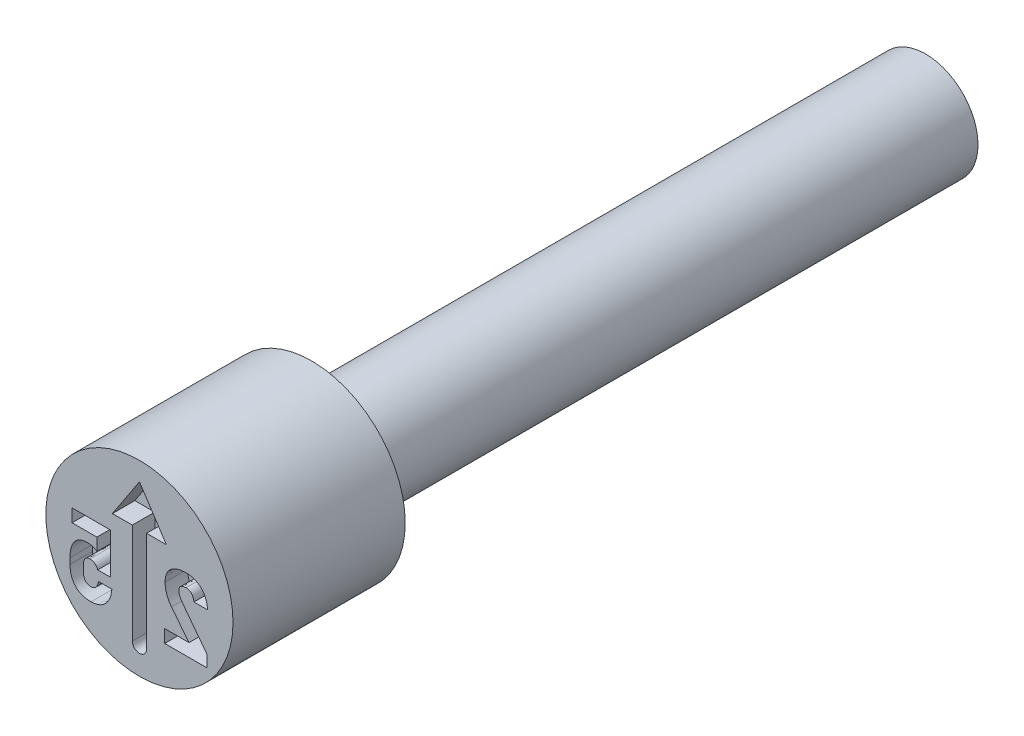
ISO-10303-21;
HEADER;
FILE_DESCRIPTION(('STEP AP214'),'2;1');
FILE_NAME('part.step','',(''),(''),'','','');
FILE_SCHEMA(('AUTOMOTIVE_DESIGN { 1 0 10303 214 1 1 1 1 }'));
ENDSEC;
DATA;
#1=APPLICATION_CONTEXT('core data for automotive mechanical design processes');
#2=APPLICATION_PROTOCOL_DEFINITION('international standard','automotive_design',2000,#1);
#3=PRODUCT_CONTEXT('',#1,'mechanical');
#4=PRODUCT('Part','Part','',(#3));
#5=PRODUCT_RELATED_PRODUCT_CATEGORY('part','',(#4));
#6=PRODUCT_DEFINITION_FORMATION('','',#4);
#7=PRODUCT_DEFINITION_CONTEXT('part definition',#1,'design');
#8=PRODUCT_DEFINITION('design','',#6,#7);
#9=PRODUCT_DEFINITION_SHAPE('','',#8);
#10=(LENGTH_UNIT() NAMED_UNIT(*) SI_UNIT(.MILLI.,.METRE.));
#11=(NAMED_UNIT(*) PLANE_ANGLE_UNIT() SI_UNIT($,.RADIAN.));
#12=(NAMED_UNIT(*) SI_UNIT($,.STERADIAN.) SOLID_ANGLE_UNIT());
#13=UNCERTAINTY_MEASURE_WITH_UNIT(LENGTH_MEASURE(1.E-05),#10,'distance_accuracy_value','');
#14=(GEOMETRIC_REPRESENTATION_CONTEXT(3) GLOBAL_UNCERTAINTY_ASSIGNED_CONTEXT((#13)) GLOBAL_UNIT_ASSIGNED_CONTEXT((#10,
#11,#12)) REPRESENTATION_CONTEXT('',''));
#15=CARTESIAN_POINT('',(0.,0.,0.));
#16=DIRECTION('',(0.,0.,1.));
#17=DIRECTION('',(1.,0.,0.));
#18=AXIS2_PLACEMENT_3D('',#15,#16,#17);
#19=CARTESIAN_POINT('',(0.,0.699999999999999,-2.3));
#20=DIRECTION('',(0.,0.,1.));
#21=DIRECTION('',(1.,0.,0.));
#22=AXIS2_PLACEMENT_3D('',#19,#20,#21);
#23=PLANE('',#22);
#24=CARTESIAN_POINT('',(0.,0.,-2.3));
#25=DIRECTION('',(0.,0.,1.));
#26=DIRECTION('',(1.,0.,0.));
#27=AXIS2_PLACEMENT_3D('',#24,#25,#26);
#28=CIRCLE('',#27,1.25);
#29=CARTESIAN_POINT('',(1.25,0.,-2.3));
#30=VERTEX_POINT('',#29);
#31=EDGE_CURVE('E11',#30,#30,#28,.T.);
#32=ORIENTED_EDGE('',*,*,#31,.F.);
#33=EDGE_LOOP('',(#32));
#34=FACE_BOUND('',#33,.T.);
#35=CARTESIAN_POINT('',(0.,0.,-2.3));
#36=DIRECTION('',(0.,0.,1.));
#37=DIRECTION('',(1.,0.,0.));
#38=AXIS2_PLACEMENT_3D('',#35,#36,#37);
#39=CIRCLE('',#38,0.699999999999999);
#40=CARTESIAN_POINT('',(0.699999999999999,0.,-2.3));
#41=VERTEX_POINT('',#40);
#42=EDGE_CURVE('E571',#41,#41,#39,.T.);
#43=ORIENTED_EDGE('',*,*,#42,.T.);
#44=EDGE_LOOP('',(#43));
#45=FACE_BOUND('',#44,.T.);
#46=ADVANCED_FACE('F34',(#34,#45),#23,.F.);
#47=CARTESIAN_POINT('',(0.,0.,-0.403888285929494));
#48=DIRECTION('',(0.,0.,1.));
#49=DIRECTION('',(1.,0.,0.));
#50=AXIS2_PLACEMENT_3D('',#47,#48,#49);
#51=CYLINDRICAL_SURFACE('',#50,1.25);
#52=CARTESIAN_POINT('',(0.,0.,0.));
#53=DIRECTION('',(0.,0.,1.));
#54=DIRECTION('',(1.,0.,0.));
#55=AXIS2_PLACEMENT_3D('',#52,#53,#54);
#56=CIRCLE('',#55,1.25);
#57=CARTESIAN_POINT('',(1.25,0.,0.));
#58=VERTEX_POINT('',#57);
#59=EDGE_CURVE('E41',#58,#58,#56,.T.);
#60=ORIENTED_EDGE('',*,*,#59,.F.);
#61=EDGE_LOOP('',(#60));
#62=FACE_BOUND('',#61,.T.);
#63=ORIENTED_EDGE('',*,*,#31,.T.);
#64=EDGE_LOOP('',(#63));
#65=FACE_BOUND('',#64,.T.);
#66=ADVANCED_FACE('F593',(#62,#65),#51,.T.);
#67=CARTESIAN_POINT('',(0.,1.25,0.));
#68=DIRECTION('',(0.,0.,-1.));
#69=DIRECTION('',(-1.,0.,0.));
#70=AXIS2_PLACEMENT_3D('',#67,#68,#69);
#71=PLANE('',#70);
#72=DIRECTION('',(-0.60539313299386,0.795926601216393,0.));
#73=VECTOR('',#72,1.);
#74=CARTESIAN_POINT('',(0.89935811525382,-0.538536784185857,0.));
#75=LINE('',#74,#73);
#76=CARTESIAN_POINT('',(0.89935811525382,-0.538536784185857,0.));
#77=VERTEX_POINT('',#76);
#78=CARTESIAN_POINT('',(0.573334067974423,-0.10990421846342,0.));
#79=VERTEX_POINT('',#78);
#80=EDGE_CURVE('E1034',#77,#79,#75,.T.);
#81=ORIENTED_EDGE('',*,*,#80,.F.);
#82=DIRECTION('',(0.,1.,0.));
#83=VECTOR('',#82,1.);
#84=CARTESIAN_POINT('',(0.89935811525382,-0.7,0.));
#85=LINE('',#84,#83);
#86=CARTESIAN_POINT('',(0.89935811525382,-0.7,0.));
#87=VERTEX_POINT('',#86);
#88=EDGE_CURVE('E48',#87,#77,#85,.T.);
#89=ORIENTED_EDGE('',*,*,#88,.F.);
#90=DIRECTION('',(1.,0.,0.));
#91=VECTOR('',#90,1.);
#92=CARTESIAN_POINT('',(0.337528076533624,-0.7,0.));
#93=LINE('',#92,#91);
#94=CARTESIAN_POINT('',(0.337528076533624,-0.7,0.));
#95=VERTEX_POINT('',#94);
#96=EDGE_CURVE('E329',#95,#87,#93,.T.);
#97=ORIENTED_EDGE('',*,*,#96,.F.);
#98=DIRECTION('',(0.,-1.,0.));
#99=VECTOR('',#98,1.);
#100=CARTESIAN_POINT('',(0.337528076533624,-0.527501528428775,0.));
#101=LINE('',#100,#99);
#102=CARTESIAN_POINT('',(0.337528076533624,-0.527501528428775,0.));
#103=VERTEX_POINT('',#102);
#104=EDGE_CURVE('E332',#103,#95,#101,.T.);
#105=ORIENTED_EDGE('',*,*,#104,.F.);
#106=DIRECTION('',(-1.,0.,0.));
#107=VECTOR('',#106,1.);
#108=CARTESIAN_POINT('',(0.66219691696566,-0.527501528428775,0.));
#109=LINE('',#108,#107);
#110=CARTESIAN_POINT('',(0.66219691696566,-0.527501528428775,0.));
#111=VERTEX_POINT('',#110);
#112=EDGE_CURVE('E1102',#111,#103,#109,.T.);
#113=ORIENTED_EDGE('',*,*,#112,.F.);
#114=DIRECTION('',(0.620676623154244,-0.78406666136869,0.));
#115=VECTOR('',#114,1.);
#116=CARTESIAN_POINT('',(0.428326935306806,-0.232066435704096,0.));
#117=LINE('',#116,#115);
#118=CARTESIAN_POINT('',(0.428326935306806,-0.232066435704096,0.));
#119=VERTEX_POINT('',#118);
#120=EDGE_CURVE('E1096',#119,#111,#117,.T.);
#121=ORIENTED_EDGE('',*,*,#120,.F.);
#122=CARTESIAN_POINT('',(0.342755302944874,0.0114835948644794,0.));
#123=CARTESIAN_POINT('',(0.343003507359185,0.000692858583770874,0.));
#124=CARTESIAN_POINT('',(0.343500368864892,-0.0209082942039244,0.));
#125=CARTESIAN_POINT('',(0.347931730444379,-0.053179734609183,0.));
#126=CARTESIAN_POINT('',(0.355177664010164,-0.0852647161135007,0.));
#127=CARTESIAN_POINT('',(0.365009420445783,-0.11705080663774,0.));
#128=CARTESIAN_POINT('',(0.37728656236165,-0.148007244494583,0.));
#129=CARTESIAN_POINT('',(0.391938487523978,-0.177640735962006,0.));
#130=CARTESIAN_POINT('',(0.40866656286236,-0.205875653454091,0.));
#131=CARTESIAN_POINT('',(0.421774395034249,-0.223337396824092,0.));
#132=CARTESIAN_POINT('',(0.428326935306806,-0.232066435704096,0.));
#133=B_SPLINE_CURVE_WITH_KNOTS('',3,(#122,#123,#124,#125,#126,#127,#128,#129,#130,#131,#132),
.UNSPECIFIED.,.F.,.F.,(4,1,1,1,1,1,1,1,4),(0.,0.123148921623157,0.24652244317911,
0.371108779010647,0.498350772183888,0.625999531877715,0.750879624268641,0.875465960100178,1.),.UNSPECIFIED.);
#134=CARTESIAN_POINT('',(0.342755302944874,0.0114835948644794,0.));
#135=VERTEX_POINT('',#134);
#136=EDGE_CURVE('E1091',#135,#119,#133,.T.);
#137=ORIENTED_EDGE('',*,*,#136,.F.);
#138=DIRECTION('',(0.,-1.,0.));
#139=VECTOR('',#138,1.);
#140=CARTESIAN_POINT('',(0.342755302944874,0.012257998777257,0.));
#141=LINE('',#140,#139);
#142=CARTESIAN_POINT('',(0.342755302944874,0.012257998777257,0.));
#143=VERTEX_POINT('',#142);
#144=EDGE_CURVE('E1085',#143,#135,#141,.T.);
#145=ORIENTED_EDGE('',*,*,#144,.F.);
#146=CARTESIAN_POINT('',(0.623670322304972,0.259873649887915,0.));
#147=CARTESIAN_POINT('',(0.609390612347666,0.259575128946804,0.));
#148=CARTESIAN_POINT('',(0.581753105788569,0.258997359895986,0.));
#149=CARTESIAN_POINT('',(0.541956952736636,0.253558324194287,0.));
#150=CARTESIAN_POINT('',(0.505363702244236,0.244507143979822,0.));
#151=CARTESIAN_POINT('',(0.47206515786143,0.231790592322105,0.));
#152=CARTESIAN_POINT('',(0.442279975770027,0.215443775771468,0.));
#153=CARTESIAN_POINT('',(0.415870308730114,0.196040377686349,0.));
#154=CARTESIAN_POINT('',(0.393581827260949,0.172827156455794,0.));
#155=CARTESIAN_POINT('',(0.375042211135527,0.146456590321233,0.));
#156=CARTESIAN_POINT('',(0.360427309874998,0.117030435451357,0.));
#157=CARTESIAN_POINT('',(0.350192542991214,0.0845740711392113,0.));
#158=CARTESIAN_POINT('',(0.343924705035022,0.0493482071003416,0.));
#159=CARTESIAN_POINT('',(0.343152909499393,0.0248689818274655,0.));
#160=CARTESIAN_POINT('',(0.342755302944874,0.012257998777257,0.));
#161=B_SPLINE_CURVE_WITH_KNOTS('',3,(#146,#147,#148,#149,#150,#151,#152,#153,#154,#155,#156,
#157,#158,#159,#160),.UNSPECIFIED.,.F.,.F.,(4,1,1,1,1,1,1,1,1,1,1,1,4),(0.,0.100715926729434,
0.194929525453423,0.2827284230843,0.366191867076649,0.445669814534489,0.521804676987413,
0.596515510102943,0.671682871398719,0.748455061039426,0.827368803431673,0.911065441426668,1.),.UNSPECIFIED.);
#162=CARTESIAN_POINT('',(0.623670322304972,0.259873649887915,0.));
#163=VERTEX_POINT('',#162);
#164=EDGE_CURVE('E1077',#163,#143,#161,.T.);
#165=ORIENTED_EDGE('',*,*,#164,.F.);
#166=CARTESIAN_POINT('',(0.911167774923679,-0.0243325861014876,0.));
#167=CARTESIAN_POINT('',(0.909852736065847,-0.0100305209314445,0.));
#168=CARTESIAN_POINT('',(0.90729096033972,0.0178307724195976,0.));
#169=CARTESIAN_POINT('',(0.898580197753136,0.0578975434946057,0.));
#170=CARTESIAN_POINT('',(0.885711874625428,0.094764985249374,0.));
#171=CARTESIAN_POINT('',(0.869270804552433,0.128534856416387,0.));
#172=CARTESIAN_POINT('',(0.849111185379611,0.158780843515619,0.));
#173=CARTESIAN_POINT('',(0.825720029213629,0.185494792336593,0.));
#174=CARTESIAN_POINT('',(0.798838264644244,0.208157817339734,0.));
#175=CARTESIAN_POINT('',(0.768931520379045,0.226989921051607,0.));
#176=CARTESIAN_POINT('',(0.73613042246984,0.241727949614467,0.));
#177=CARTESIAN_POINT('',(0.70083611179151,0.252466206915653,0.));
#178=CARTESIAN_POINT('',(0.662995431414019,0.258656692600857,0.));
#179=CARTESIAN_POINT('',(0.636986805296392,0.259461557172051,0.));
#180=CARTESIAN_POINT('',(0.623670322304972,0.259873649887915,0.));
#181=B_SPLINE_CURVE_WITH_KNOTS('',3,(#166,#167,#168,#169,#170,#171,#172,#173,#174,#175,#176,
#177,#178,#179,#180),.UNSPECIFIED.,.F.,.F.,(4,1,1,1,1,1,1,1,1,1,1,1,4),(0.,0.0953291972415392,
0.185707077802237,0.271513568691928,0.35413169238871,0.434493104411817,0.512233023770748,
0.58917600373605,0.667186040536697,0.746219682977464,0.827302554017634,0.911578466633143,1.),.UNSPECIFIED.);
#182=CARTESIAN_POINT('',(0.911167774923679,-0.0243325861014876,0.));
#183=VERTEX_POINT('',#182);
#184=EDGE_CURVE('E1072',#183,#163,#181,.T.);
#185=ORIENTED_EDGE('',*,*,#184,.F.);
#186=DIRECTION('',(0.,1.,0.));
#187=VECTOR('',#186,1.);
#188=CARTESIAN_POINT('',(0.911167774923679,-0.0251069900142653,0.));
#189=LINE('',#188,#187);
#190=CARTESIAN_POINT('',(0.911167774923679,-0.0251069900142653,0.));
#191=VERTEX_POINT('',#190);
#192=EDGE_CURVE('E1069',#191,#183,#189,.T.);
#193=ORIENTED_EDGE('',*,*,#192,.F.);
#194=DIRECTION('',(1.,0.,0.));
#195=VECTOR('',#194,1.);
#196=CARTESIAN_POINT('',(0.727634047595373,-0.0251069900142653,0.));
#197=LINE('',#196,#195);
#198=CARTESIAN_POINT('',(0.727634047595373,-0.0251069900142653,0.));
#199=VERTEX_POINT('',#198);
#200=EDGE_CURVE('E1066',#199,#191,#197,.T.);
#201=ORIENTED_EDGE('',*,*,#200,.F.);
#202=DIRECTION('',(0.,-1.,0.));
#203=VECTOR('',#202,1.);
#204=CARTESIAN_POINT('',(0.727634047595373,-0.0243325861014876,0.));
#205=LINE('',#204,#203);
#206=CARTESIAN_POINT('',(0.727634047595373,-0.0243325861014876,0.));
#207=VERTEX_POINT('',#206);
#208=EDGE_CURVE('E1060',#207,#199,#205,.T.);
#209=ORIENTED_EDGE('',*,*,#208,.F.);
#210=CARTESIAN_POINT('',(0.622315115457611,0.0873751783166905,0.));
#211=CARTESIAN_POINT('',(0.629385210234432,0.0870765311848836,0.));
#212=CARTESIAN_POINT('',(0.643106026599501,0.0864969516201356,0.));
#213=CARTESIAN_POINT('',(0.662623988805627,0.0809741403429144,0.));
#214=CARTESIAN_POINT('',(0.679962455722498,0.0715979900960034,0.));
#215=CARTESIAN_POINT('',(0.694971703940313,0.058639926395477,0.));
#216=CARTESIAN_POINT('',(0.70756582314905,0.0423386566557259,0.));
#217=CARTESIAN_POINT('',(0.716848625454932,0.0227009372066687,0.));
#218=CARTESIAN_POINT('',(0.724324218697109,0.000381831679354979,0.));
#219=CARTESIAN_POINT('',(0.726493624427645,-0.0158170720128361,0.));
#220=CARTESIAN_POINT('',(0.727634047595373,-0.0243325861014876,0.));
#221=B_SPLINE_CURVE_WITH_KNOTS('',3,(#210,#211,#212,#213,#214,#215,#216,#217,#218,#219,#220),
.UNSPECIFIED.,.F.,.F.,(4,1,1,1,1,1,1,1,4),(0.,0.124212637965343,0.241057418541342,
0.353359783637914,0.468536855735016,0.587568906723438,0.713021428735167,0.849139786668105,1.),.UNSPECIFIED.);
#222=CARTESIAN_POINT('',(0.622315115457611,0.0873751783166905,0.));
#223=VERTEX_POINT('',#222);
#224=EDGE_CURVE('E1052',#223,#207,#221,.T.);
#225=ORIENTED_EDGE('',*,*,#224,.F.);
#226=CARTESIAN_POINT('',(0.527063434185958,0.00703077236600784,0.));
#227=CARTESIAN_POINT('',(0.527323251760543,0.0131309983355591,0.));
#228=CARTESIAN_POINT('',(0.527818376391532,0.0247559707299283,0.));
#229=CARTESIAN_POINT('',(0.532598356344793,0.0411111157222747,0.));
#230=CARTESIAN_POINT('',(0.540502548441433,0.055253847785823,0.));
#231=CARTESIAN_POINT('',(0.551574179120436,0.0671094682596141,0.));
#232=CARTESIAN_POINT('',(0.565657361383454,0.0762210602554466,0.));
#233=CARTESIAN_POINT('',(0.582269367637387,0.082877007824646,0.));
#234=CARTESIAN_POINT('',(0.601498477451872,0.0866430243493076,0.));
#235=CARTESIAN_POINT('',(0.615135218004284,0.0871226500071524,0.));
#236=CARTESIAN_POINT('',(0.622315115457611,0.0873751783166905,0.));
#237=B_SPLINE_CURVE_WITH_KNOTS('',3,(#226,#227,#228,#229,#230,#231,#232,#233,#234,#235,#236),
.UNSPECIFIED.,.F.,.F.,(4,1,1,1,1,1,1,1,4),(0.,0.129170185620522,0.246154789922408,
0.35773418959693,0.470108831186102,0.586692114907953,0.710769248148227,0.847716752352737,1.),.UNSPECIFIED.);
#238=CARTESIAN_POINT('',(0.527063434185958,0.00703077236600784,0.));
#239=VERTEX_POINT('',#238);
#240=EDGE_CURVE('E1047',#239,#223,#237,.T.);
#241=ORIENTED_EDGE('',*,*,#240,.F.);
#242=DIRECTION('',(0.,1.,0.));
#243=VECTOR('',#242,1.);
#244=CARTESIAN_POINT('',(0.527063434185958,0.0056755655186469,0.));
#245=LINE('',#244,#243);
#246=CARTESIAN_POINT('',(0.527063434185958,0.0056755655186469,0.));
#247=VERTEX_POINT('',#246);
#248=EDGE_CURVE('E1041',#247,#239,#245,.T.);
#249=ORIENTED_EDGE('',*,*,#248,.F.);
#250=CARTESIAN_POINT('',(0.573334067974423,-0.10990421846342,0.));
#251=CARTESIAN_POINT('',(0.566496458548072,-0.100417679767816,0.));
#252=CARTESIAN_POINT('',(0.553148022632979,-0.0818979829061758,0.));
#253=CARTESIAN_POINT('',(0.541205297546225,-0.0563541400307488,0.));
#254=CARTESIAN_POINT('',(0.53361847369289,-0.0363251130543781,0.));
#255=CARTESIAN_POINT('',(0.530110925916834,-0.0217963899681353,0.));
#256=CARTESIAN_POINT('',(0.527514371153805,-0.00790365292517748,0.));
#257=CARTESIAN_POINT('',(0.527211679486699,0.00121140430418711,0.));
#258=CARTESIAN_POINT('',(0.527063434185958,0.0056755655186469,0.));
#259=B_SPLINE_CURVE_WITH_KNOTS('',3,(#250,#251,#252,#253,#254,#255,#256,#257,#258),
.UNSPECIFIED.,.F.,.F.,(4,1,1,1,1,1,4),(0.,0.27673722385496,0.540248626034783,0.66563356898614,
0.784034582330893,0.894229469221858,1.),.UNSPECIFIED.);
#260=EDGE_CURVE('E1036',#79,#247,#259,.T.);
#261=ORIENTED_EDGE('',*,*,#260,.F.);
#262=EDGE_LOOP('',(#81,#89,#97,#105,#113,#121,#137,#145,#165,#185,#193,#201,#209,#225,#241,#249,#261));
#263=FACE_BOUND('',#262,.T.);
#264=CARTESIAN_POINT('',(-0.647157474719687,-0.709873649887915,0.));
#265=CARTESIAN_POINT('',(-0.634671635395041,-0.709492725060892,0.));
#266=CARTESIAN_POINT('',(-0.610238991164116,-0.708747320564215,0.));
#267=CARTESIAN_POINT('',(-0.574624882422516,-0.70205564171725,0.));
#268=CARTESIAN_POINT('',(-0.540861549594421,-0.69169236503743,0.));
#269=CARTESIAN_POINT('',(-0.509200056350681,-0.676908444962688,0.));
#270=CARTESIAN_POINT('',(-0.479984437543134,-0.658125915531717,0.));
#271=CARTESIAN_POINT('',(-0.453860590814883,-0.635158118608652,0.));
#272=CARTESIAN_POINT('',(-0.430588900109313,-0.60860639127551,0.));
#273=CARTESIAN_POINT('',(-0.410636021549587,-0.578238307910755,0.));
#274=CARTESIAN_POINT('',(-0.394204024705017,-0.544378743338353,0.));
#275=CARTESIAN_POINT('',(-0.381411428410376,-0.507426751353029,0.));
#276=CARTESIAN_POINT('',(-0.372624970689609,-0.467448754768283,0.));
#277=CARTESIAN_POINT('',(-0.370070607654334,-0.439712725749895,0.));
#278=CARTESIAN_POINT('',(-0.368759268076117,-0.425473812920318,0.));
#279=B_SPLINE_CURVE_WITH_KNOTS('',3,(#264,#265,#266,#267,#268,#269,#270,#271,#272,#273,#274,
#275,#276,#277,#278),.UNSPECIFIED.,.F.,.F.,(4,1,1,1,1,1,1,1,1,1,1,1,4),(0.,0.0844304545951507,
0.165215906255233,0.244369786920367,0.322918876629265,0.400936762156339,0.478631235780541,
0.557558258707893,0.639203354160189,0.723781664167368,0.811629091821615,0.903295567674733,1.),.UNSPECIFIED.);
#280=CARTESIAN_POINT('',(-0.647157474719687,-0.709873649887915,0.));
#281=VERTEX_POINT('',#280);
#282=CARTESIAN_POINT('',(-0.368759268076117,-0.425473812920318,0.));
#283=VERTEX_POINT('',#282);
#284=EDGE_CURVE('E396',#281,#283,#279,.T.);
#285=ORIENTED_EDGE('',*,*,#284,.F.);
#286=CARTESIAN_POINT('',(-0.927298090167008,-0.418310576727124,0.));
#287=CARTESIAN_POINT('',(-0.926873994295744,-0.433106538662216,0.));
#288=CARTESIAN_POINT('',(-0.926053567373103,-0.461729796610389,0.));
#289=CARTESIAN_POINT('',(-0.920186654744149,-0.503121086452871,0.));
#290=CARTESIAN_POINT('',(-0.909610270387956,-0.541088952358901,0.));
#291=CARTESIAN_POINT('',(-0.8954394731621,-0.575878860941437,0.));
#292=CARTESIAN_POINT('',(-0.876935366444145,-0.606799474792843,0.));
#293=CARTESIAN_POINT('',(-0.854777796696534,-0.634111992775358,0.));
#294=CARTESIAN_POINT('',(-0.828562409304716,-0.657185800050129,0.));
#295=CARTESIAN_POINT('',(-0.798907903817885,-0.676604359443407,0.));
#296=CARTESIAN_POINT('',(-0.765532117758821,-0.691497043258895,0.));
#297=CARTESIAN_POINT('',(-0.72896839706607,-0.702316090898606,0.));
#298=CARTESIAN_POINT('',(-0.689072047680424,-0.708751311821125,0.));
#299=CARTESIAN_POINT('',(-0.661443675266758,-0.709491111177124,0.));
#300=CARTESIAN_POINT('',(-0.647157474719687,-0.709873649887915,0.));
#301=B_SPLINE_CURVE_WITH_KNOTS('',3,(#286,#287,#288,#289,#290,#291,#292,#293,#294,#295,#296,
#297,#298,#299,#300),.UNSPECIFIED.,.F.,.F.,(4,1,1,1,1,1,1,1,1,1,1,1,4),(0.,0.096591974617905,
0.1868602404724,0.272108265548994,0.35332451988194,0.431359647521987,0.506505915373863,
0.582010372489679,0.6584354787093,0.737063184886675,0.819709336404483,0.906774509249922,1.),.UNSPECIFIED.);
#302=CARTESIAN_POINT('',(-0.927298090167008,-0.418310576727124,0.));
#303=VERTEX_POINT('',#302);
#304=EDGE_CURVE('E56',#303,#281,#301,.T.);
#305=ORIENTED_EDGE('',*,*,#304,.F.);
#306=DIRECTION('',(0.,-1.,0.));
#307=VECTOR('',#306,1.);
#308=CARTESIAN_POINT('',(-0.927298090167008,-0.338740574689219,0.));
#309=LINE('',#308,#307);
#310=CARTESIAN_POINT('',(-0.927298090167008,-0.338740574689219,0.));
#311=VERTEX_POINT('',#310);
#312=EDGE_CURVE('E482',#311,#303,#309,.T.);
#313=ORIENTED_EDGE('',*,*,#312,.F.);
#314=CARTESIAN_POINT('',(-0.693428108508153,-0.0479519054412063,0.));
#315=CARTESIAN_POINT('',(-0.705334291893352,-0.048328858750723,0.));
#316=CARTESIAN_POINT('',(-0.728426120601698,-0.049059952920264,0.));
#317=CARTESIAN_POINT('',(-0.761734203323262,-0.0556363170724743,0.));
#318=CARTESIAN_POINT('',(-0.79243069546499,-0.0661723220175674,0.));
#319=CARTESIAN_POINT('',(-0.820262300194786,-0.0813516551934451,0.));
#320=CARTESIAN_POINT('',(-0.845260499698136,-0.100376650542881,0.));
#321=CARTESIAN_POINT('',(-0.866973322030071,-0.12362364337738,0.));
#322=CARTESIAN_POINT('',(-0.88553612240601,-0.150713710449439,0.));
#323=CARTESIAN_POINT('',(-0.900728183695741,-0.181664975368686,0.));
#324=CARTESIAN_POINT('',(-0.912684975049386,-0.216206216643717,0.));
#325=CARTESIAN_POINT('',(-0.921369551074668,-0.254096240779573,0.));
#326=CARTESIAN_POINT('',(-0.926318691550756,-0.295371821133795,0.));
#327=CARTESIAN_POINT('',(-0.926964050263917,-0.323948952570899,0.));
#328=CARTESIAN_POINT('',(-0.927298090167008,-0.338740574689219,0.));
#329=B_SPLINE_CURVE_WITH_KNOTS('',3,(#314,#315,#316,#317,#318,#319,#320,#321,#322,#323,#324,
#325,#326,#327,#328),.UNSPECIFIED.,.F.,.F.,(4,1,1,1,1,1,1,1,1,1,1,1,4),(0.,0.0843949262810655,
0.163682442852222,0.239848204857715,0.313806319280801,0.387615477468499,0.461788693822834,
0.538496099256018,0.61978489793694,0.70565234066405,0.797279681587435,0.895071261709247,1.),.UNSPECIFIED.);
#330=CARTESIAN_POINT('',(-0.693428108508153,-0.0479519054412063,0.));
#331=VERTEX_POINT('',#330);
#332=EDGE_CURVE('E474',#331,#311,#329,.T.);
#333=ORIENTED_EDGE('',*,*,#332,.F.);
#334=CARTESIAN_POINT('',(-0.568749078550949,-0.0903505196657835,0.));
#335=CARTESIAN_POINT('',(-0.572353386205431,-0.0871589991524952,0.));
#336=CARTESIAN_POINT('',(-0.579767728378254,-0.0805937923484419,0.));
#337=CARTESIAN_POINT('',(-0.592730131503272,-0.0722578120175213,0.));
#338=CARTESIAN_POINT('',(-0.607555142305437,-0.0651777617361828,0.));
#339=CARTESIAN_POINT('',(-0.629430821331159,-0.0570234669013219,0.));
#340=CARTESIAN_POINT('',(-0.658207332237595,-0.049772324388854,0.));
#341=CARTESIAN_POINT('',(-0.68183083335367,-0.0485513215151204,0.));
#342=CARTESIAN_POINT('',(-0.693428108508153,-0.0479519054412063,0.));
#343=B_SPLINE_CURVE_WITH_KNOTS('',3,(#334,#335,#336,#337,#338,#339,#340,#341,#342),
.UNSPECIFIED.,.F.,.F.,(4,1,1,1,1,1,4),(0.,0.10729164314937,0.220707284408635,0.342410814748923,
0.473179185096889,0.741372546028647,1.),.UNSPECIFIED.);
#344=CARTESIAN_POINT('',(-0.568749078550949,-0.0903505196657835,0.));
#345=VERTEX_POINT('',#344);
#346=EDGE_CURVE('E469',#345,#331,#343,.T.);
#347=ORIENTED_EDGE('',*,*,#346,.F.);
#348=DIRECTION('',(0.,-1.,0.));
#349=VECTOR('',#348,1.);
#350=CARTESIAN_POINT('',(-0.568749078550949,0.0775015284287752,0.));
#351=LINE('',#350,#349);
#352=CARTESIAN_POINT('',(-0.568749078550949,0.0775015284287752,0.));
#353=VERTEX_POINT('',#352);
#354=EDGE_CURVE('E466',#353,#345,#351,.T.);
#355=ORIENTED_EDGE('',*,*,#354,.F.);
#356=DIRECTION('',(1.,0.,0.));
#357=VECTOR('',#356,1.);
#358=CARTESIAN_POINT('',(-0.900000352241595,0.0775015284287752,0.));
#359=LINE('',#358,#357);
#360=CARTESIAN_POINT('',(-0.900000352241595,0.0775015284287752,0.));
#361=VERTEX_POINT('',#360);
#362=EDGE_CURVE('E463',#361,#353,#359,.T.);
#363=ORIENTED_EDGE('',*,*,#362,.F.);
#364=DIRECTION('',(0.,-1.,0.));
#365=VECTOR('',#364,1.);
#366=CARTESIAN_POINT('',(-0.900000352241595,0.25,0.));
#367=LINE('',#366,#365);
#368=CARTESIAN_POINT('',(-0.900000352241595,0.25,0.));
#369=VERTEX_POINT('',#368);
#370=EDGE_CURVE('E460',#369,#361,#367,.T.);
#371=ORIENTED_EDGE('',*,*,#370,.F.);
#372=DIRECTION('',(-1.,0.,0.));
#373=VECTOR('',#372,1.);
#374=CARTESIAN_POINT('',(-0.389668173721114,0.25,0.));
#375=LINE('',#374,#373);
#376=CARTESIAN_POINT('',(-0.389668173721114,0.25,0.));
#377=VERTEX_POINT('',#376);
#378=EDGE_CURVE('E457',#377,#369,#375,.T.);
#379=ORIENTED_EDGE('',*,*,#378,.F.);
#380=DIRECTION('',(0.,1.,0.));
#381=VECTOR('',#380,1.);
#382=CARTESIAN_POINT('',(-0.389668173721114,-0.296148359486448,0.));
#383=LINE('',#382,#381);
#384=CARTESIAN_POINT('',(-0.389668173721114,-0.296148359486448,0.));
#385=VERTEX_POINT('',#384);
#386=EDGE_CURVE('E454',#385,#377,#383,.T.);
#387=ORIENTED_EDGE('',*,*,#386,.F.);
#388=DIRECTION('',(1.,0.,0.));
#389=VECTOR('',#388,1.);
#390=CARTESIAN_POINT('',(-0.55693941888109,-0.296148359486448,0.));
#391=LINE('',#390,#389);
#392=CARTESIAN_POINT('',(-0.55693941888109,-0.296148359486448,0.));
#393=VERTEX_POINT('',#392);
#394=EDGE_CURVE('E448',#393,#385,#391,.T.);
#395=ORIENTED_EDGE('',*,*,#394,.F.);
#396=CARTESIAN_POINT('',(-0.660128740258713,-0.221611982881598,0.));
#397=CARTESIAN_POINT('',(-0.653913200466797,-0.221801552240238,0.));
#398=CARTESIAN_POINT('',(-0.641880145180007,-0.222168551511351,0.));
#399=CARTESIAN_POINT('',(-0.624554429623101,-0.225968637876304,0.));
#400=CARTESIAN_POINT('',(-0.608630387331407,-0.232186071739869,0.));
#401=CARTESIAN_POINT('',(-0.594288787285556,-0.240976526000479,0.));
#402=CARTESIAN_POINT('',(-0.581622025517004,-0.251750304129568,0.));
#403=CARTESIAN_POINT('',(-0.571193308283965,-0.264768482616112,0.));
#404=CARTESIAN_POINT('',(-0.56245106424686,-0.279478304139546,0.));
#405=CARTESIAN_POINT('',(-0.558803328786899,-0.290510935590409,0.));
#406=CARTESIAN_POINT('',(-0.55693941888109,-0.296148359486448,0.));
#407=B_SPLINE_CURVE_WITH_KNOTS('',3,(#396,#397,#398,#399,#400,#401,#402,#403,#404,#405,#406),
.UNSPECIFIED.,.F.,.F.,(4,1,1,1,1,1,1,1,4),(0.,0.135635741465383,0.262585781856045,
0.385395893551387,0.507524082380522,0.628507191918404,0.746772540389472,0.870606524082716,1.),.UNSPECIFIED.);
#408=CARTESIAN_POINT('',(-0.660128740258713,-0.221611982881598,0.));
#409=VERTEX_POINT('',#408);
#410=EDGE_CURVE('E440',#409,#393,#407,.T.);
#411=ORIENTED_EDGE('',*,*,#410,.F.);
#412=CARTESIAN_POINT('',(-0.748410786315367,-0.338740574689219,0.));
#413=CARTESIAN_POINT('',(-0.748219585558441,-0.329875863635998,0.));
#414=CARTESIAN_POINT('',(-0.747856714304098,-0.313051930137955,0.));
#415=CARTESIAN_POINT('',(-0.743342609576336,-0.289517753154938,0.));
#416=CARTESIAN_POINT('',(-0.73632406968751,-0.268984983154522,0.));
#417=CARTESIAN_POINT('',(-0.725958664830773,-0.251940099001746,0.));
#418=CARTESIAN_POINT('',(-0.713073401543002,-0.238182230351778,0.));
#419=CARTESIAN_POINT('',(-0.697480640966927,-0.228410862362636,0.));
#420=CARTESIAN_POINT('',(-0.679493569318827,-0.222639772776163,0.));
#421=CARTESIAN_POINT('',(-0.666754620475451,-0.221963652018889,0.));
#422=CARTESIAN_POINT('',(-0.660128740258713,-0.221611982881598,0.));
#423=B_SPLINE_CURVE_WITH_KNOTS('',3,(#412,#413,#414,#415,#416,#417,#418,#419,#420,#421,#422),
.UNSPECIFIED.,.F.,.F.,(4,1,1,1,1,1,1,1,4),(0.,0.160198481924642,0.304033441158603,
0.431843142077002,0.550810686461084,0.662316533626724,0.769888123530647,0.880312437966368,1.),.UNSPECIFIED.);
#424=CARTESIAN_POINT('',(-0.748410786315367,-0.338740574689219,0.));
#425=VERTEX_POINT('',#424);
#426=EDGE_CURVE('E435',#425,#409,#423,.T.);
#427=ORIENTED_EDGE('',*,*,#426,.F.);
#428=DIRECTION('',(0.,1.,0.));
#429=VECTOR('',#428,1.);
#430=CARTESIAN_POINT('',(-0.748410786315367,-0.418310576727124,0.));
#431=LINE('',#430,#429);
#432=CARTESIAN_POINT('',(-0.748410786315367,-0.418310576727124,0.));
#433=VERTEX_POINT('',#432);
#434=EDGE_CURVE('E429',#433,#425,#431,.T.);
#435=ORIENTED_EDGE('',*,*,#434,.F.);
#436=CARTESIAN_POINT('',(-0.649674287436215,-0.536019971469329,0.));
#437=CARTESIAN_POINT('',(-0.657140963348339,-0.535694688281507,0.));
#438=CARTESIAN_POINT('',(-0.671422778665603,-0.535072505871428,0.));
#439=CARTESIAN_POINT('',(-0.691441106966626,-0.529067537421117,0.));
#440=CARTESIAN_POINT('',(-0.708867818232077,-0.519453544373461,0.));
#441=CARTESIAN_POINT('',(-0.723262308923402,-0.505619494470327,0.));
#442=CARTESIAN_POINT('',(-0.734745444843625,-0.488382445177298,0.));
#443=CARTESIAN_POINT('',(-0.742873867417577,-0.467741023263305,0.));
#444=CARTESIAN_POINT('',(-0.747687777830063,-0.444022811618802,0.));
#445=CARTESIAN_POINT('',(-0.748161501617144,-0.427175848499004,0.));
#446=CARTESIAN_POINT('',(-0.748410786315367,-0.418310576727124,0.));
#447=B_SPLINE_CURVE_WITH_KNOTS('',3,(#436,#437,#438,#439,#440,#441,#442,#443,#444,#445,#446),
.UNSPECIFIED.,.F.,.F.,(4,1,1,1,1,1,1,1,4),(0.,0.128261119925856,0.245330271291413,
0.356275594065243,0.467886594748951,0.585607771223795,0.710231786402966,0.847517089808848,1.),.UNSPECIFIED.);
#448=CARTESIAN_POINT('',(-0.649674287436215,-0.536019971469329,0.));
#449=VERTEX_POINT('',#448);
#450=EDGE_CURVE('E421',#449,#433,#447,.T.);
#451=ORIENTED_EDGE('',*,*,#450,.F.);
#452=CARTESIAN_POINT('',(-0.547840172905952,-0.425473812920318,0.));
#453=CARTESIAN_POINT('',(-0.548862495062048,-0.433788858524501,0.));
#454=CARTESIAN_POINT('',(-0.550810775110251,-0.449635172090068,0.));
#455=CARTESIAN_POINT('',(-0.557836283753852,-0.471625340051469,0.));
#456=CARTESIAN_POINT('',(-0.567008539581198,-0.490954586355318,0.));
#457=CARTESIAN_POINT('',(-0.579124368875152,-0.507173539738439,0.));
#458=CARTESIAN_POINT('',(-0.593511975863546,-0.520341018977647,0.));
#459=CARTESIAN_POINT('',(-0.610560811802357,-0.529271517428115,0.));
#460=CARTESIAN_POINT('',(-0.629403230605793,-0.535230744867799,0.));
#461=CARTESIAN_POINT('',(-0.642785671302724,-0.535751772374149,0.));
#462=CARTESIAN_POINT('',(-0.649674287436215,-0.536019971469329,0.));
#463=B_SPLINE_CURVE_WITH_KNOTS('',3,(#452,#453,#454,#455,#456,#457,#458,#459,#460,#461,#462),
.UNSPECIFIED.,.F.,.F.,(4,1,1,1,1,1,1,1,4),(0.,0.150277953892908,0.286390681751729,
0.412971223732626,0.533144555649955,0.648163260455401,0.760273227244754,0.876600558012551,1.),.UNSPECIFIED.);
#464=CARTESIAN_POINT('',(-0.547840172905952,-0.425473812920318,0.));
#465=VERTEX_POINT('',#464);
#466=EDGE_CURVE('E416',#465,#449,#463,.T.);
#467=ORIENTED_EDGE('',*,*,#466,.F.);
#468=DIRECTION('',(0.,-1.,0.));
#469=VECTOR('',#468,1.);
#470=CARTESIAN_POINT('',(-0.547840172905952,-0.424893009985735,0.));
#471=LINE('',#470,#469);
#472=CARTESIAN_POINT('',(-0.547840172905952,-0.424893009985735,0.));
#473=VERTEX_POINT('',#472);
#474=EDGE_CURVE('E413',#473,#465,#471,.T.);
#475=ORIENTED_EDGE('',*,*,#474,.F.);
#476=DIRECTION('',(-1.,0.,0.));
#477=VECTOR('',#476,1.);
#478=CARTESIAN_POINT('',(-0.368759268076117,-0.424893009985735,0.));
#479=LINE('',#478,#477);
#480=CARTESIAN_POINT('',(-0.368759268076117,-0.424893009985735,0.));
#481=VERTEX_POINT('',#480);
#482=EDGE_CURVE('E410',#481,#473,#479,.T.);
#483=ORIENTED_EDGE('',*,*,#482,.F.);
#484=DIRECTION('',(0.,1.,0.));
#485=VECTOR('',#484,1.);
#486=CARTESIAN_POINT('',(-0.368759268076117,-0.425473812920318,0.));
#487=LINE('',#486,#485);
#488=EDGE_CURVE('E404',#283,#481,#487,.T.);
#489=ORIENTED_EDGE('',*,*,#488,.F.);
#490=EDGE_LOOP('',(#285,#305,#313,#333,#347,#355,#363,#371,#379,#387,#395,#411,#427,#435,#451,
#467,#475,#483,#489));
#491=FACE_BOUND('',#490,.T.);
#492=DIRECTION('',(0.,1.,0.));
#493=VECTOR('',#492,1.);
#494=CARTESIAN_POINT('',(0.0952365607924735,0.453175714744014,0.));
#495=LINE('',#494,#493);
#496=CARTESIAN_POINT('',(0.0952365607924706,-0.888080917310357,0.));
#497=VERTEX_POINT('',#496);
#498=CARTESIAN_POINT('',(0.0952365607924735,0.453175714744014,0.));
#499=VERTEX_POINT('',#498);
#500=EDGE_CURVE('E551',#497,#499,#495,.T.);
#501=ORIENTED_EDGE('',*,*,#500,.F.);
#502=CARTESIAN_POINT('',(0.,-0.888080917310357,0.));
#503=DIRECTION('',(0.,0.,1.));
#504=DIRECTION('',(1.,0.,0.));
#505=AXIS2_PLACEMENT_3D('',#502,#503,#504);
#506=CIRCLE('',#505,0.0952365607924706);
#507=CARTESIAN_POINT('',(-0.0952365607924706,-0.888080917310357,0.));
#508=VERTEX_POINT('',#507);
#509=EDGE_CURVE('E549',#508,#497,#506,.T.);
#510=ORIENTED_EDGE('',*,*,#509,.F.);
#511=DIRECTION('',(0.,-1.,0.));
#512=VECTOR('',#511,1.);
#513=CARTESIAN_POINT('',(-0.0952365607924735,0.453175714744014,0.));
#514=LINE('',#513,#512);
#515=CARTESIAN_POINT('',(-0.0952365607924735,0.453175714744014,0.));
#516=VERTEX_POINT('',#515);
#517=EDGE_CURVE('E530',#516,#508,#514,.T.);
#518=ORIENTED_EDGE('',*,*,#517,.F.);
#519=DIRECTION('',(1.,0.,0.));
#520=VECTOR('',#519,1.);
#521=CARTESIAN_POINT('',(-0.360958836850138,0.453175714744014,0.));
#522=LINE('',#521,#520);
#523=CARTESIAN_POINT('',(-0.360958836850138,0.453175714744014,0.));
#524=VERTEX_POINT('',#523);
#525=EDGE_CURVE('E564',#524,#516,#522,.T.);
#526=ORIENTED_EDGE('',*,*,#525,.F.);
#527=DIRECTION('',(-0.550159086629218,-0.835059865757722,0.));
#528=VECTOR('',#527,1.);
#529=CARTESIAN_POINT('',(0.,1.00105767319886,0.));
#530=LINE('',#529,#528);
#531=CARTESIAN_POINT('',(0.,1.00105767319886,0.));
#532=VERTEX_POINT('',#531);
#533=EDGE_CURVE('E561',#532,#524,#530,.T.);
#534=ORIENTED_EDGE('',*,*,#533,.F.);
#535=DIRECTION('',(-0.550159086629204,0.835059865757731,0.));
#536=VECTOR('',#535,1.);
#537=CARTESIAN_POINT('',(0.,1.00105767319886,0.));
#538=LINE('',#537,#536);
#539=CARTESIAN_POINT('',(0.360958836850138,0.453175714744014,0.));
#540=VERTEX_POINT('',#539);
#541=EDGE_CURVE('E558',#540,#532,#538,.T.);
#542=ORIENTED_EDGE('',*,*,#541,.F.);
#543=DIRECTION('',(1.,0.,0.));
#544=VECTOR('',#543,1.);
#545=CARTESIAN_POINT('',(0.360958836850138,0.453175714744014,0.));
#546=LINE('',#545,#544);
#547=EDGE_CURVE('E555',#499,#540,#546,.T.);
#548=ORIENTED_EDGE('',*,*,#547,.F.);
#549=EDGE_LOOP('',(#501,#510,#518,#526,#534,#542,#548));
#550=FACE_BOUND('',#549,.T.);
#551=ORIENTED_EDGE('',*,*,#59,.T.);
#552=EDGE_LOOP('',(#551));
#553=FACE_BOUND('',#552,.T.);
#554=ADVANCED_FACE('F591',(#263,#491,#550,#553),#71,.F.);
#555=CARTESIAN_POINT('',(0.,0.,-10.5));
#556=DIRECTION('',(0.,0.,1.));
#557=DIRECTION('',(1.,0.,0.));
#558=AXIS2_PLACEMENT_3D('',#555,#556,#557);
#559=PLANE('',#558);
#560=CARTESIAN_POINT('',(0.,0.,-10.5));
#561=DIRECTION('',(0.,0.,1.));
#562=DIRECTION('',(1.,0.,0.));
#563=AXIS2_PLACEMENT_3D('',#560,#561,#562);
#564=CIRCLE('',#563,0.7);
#565=CARTESIAN_POINT('',(0.7,0.,-10.5));
#566=VERTEX_POINT('',#565);
#567=EDGE_CURVE('E586',#566,#566,#564,.T.);
#568=ORIENTED_EDGE('',*,*,#567,.F.);
#569=EDGE_LOOP('',(#568));
#570=FACE_BOUND('',#569,.T.);
#571=ADVANCED_FACE('F606',(#570),#559,.F.);
#572=CARTESIAN_POINT('',(0.,0.,-0.403888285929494));
#573=DIRECTION('',(0.,0.,1.));
#574=DIRECTION('',(1.,0.,0.));
#575=AXIS2_PLACEMENT_3D('',#572,#573,#574);
#576=CYLINDRICAL_SURFACE('',#575,0.699999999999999);
#577=ORIENTED_EDGE('',*,*,#42,.F.);
#578=EDGE_LOOP('',(#577));
#579=FACE_BOUND('',#578,.T.);
#580=ORIENTED_EDGE('',*,*,#567,.T.);
#581=EDGE_LOOP('',(#580));
#582=FACE_BOUND('',#581,.T.);
#583=ADVANCED_FACE('F602',(#579,#582),#576,.T.);
#584=CARTESIAN_POINT('',(0.,-0.888080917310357,-0.3));
#585=DIRECTION('',(0.,0.,1.));
#586=DIRECTION('',(1.,0.,0.));
#587=AXIS2_PLACEMENT_3D('',#584,#585,#586);
#588=CYLINDRICAL_SURFACE('',#587,0.0952365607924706);
#589=ORIENTED_EDGE('',*,*,#509,.T.);
#590=DIRECTION('',(0.,0.,1.));
#591=VECTOR('',#590,1.);
#592=CARTESIAN_POINT('',(0.0952365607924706,-0.888080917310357,-0.3));
#593=LINE('',#592,#591);
#594=CARTESIAN_POINT('',(0.0952365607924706,-0.888080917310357,-0.3));
#595=VERTEX_POINT('',#594);
#596=EDGE_CURVE('E548',#595,#497,#593,.T.);
#597=ORIENTED_EDGE('',*,*,#596,.F.);
#598=CARTESIAN_POINT('',(0.,-0.888080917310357,-0.3));
#599=DIRECTION('',(0.,0.,1.));
#600=DIRECTION('',(1.,0.,0.));
#601=AXIS2_PLACEMENT_3D('',#598,#599,#600);
#602=CIRCLE('',#601,0.0952365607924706);
#603=CARTESIAN_POINT('',(-0.0952365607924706,-0.888080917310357,-0.3));
#604=VERTEX_POINT('',#603);
#605=EDGE_CURVE('E526',#604,#595,#602,.T.);
#606=ORIENTED_EDGE('',*,*,#605,.F.);
#607=DIRECTION('',(0.,0.,1.));
#608=VECTOR('',#607,1.);
#609=CARTESIAN_POINT('',(-0.0952365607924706,-0.888080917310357,-0.3));
#610=LINE('',#609,#608);
#611=EDGE_CURVE('E569',#604,#508,#610,.T.);
#612=ORIENTED_EDGE('',*,*,#611,.T.);
#613=EDGE_LOOP('',(#589,#597,#606,#612));
#614=FACE_BOUND('',#613,.T.);
#615=ADVANCED_FACE('F605',(#614),#588,.F.);
#616=CARTESIAN_POINT('',(-0.0952365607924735,0.453175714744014,-0.3));
#617=DIRECTION('',(-1.,0.,0.));
#618=DIRECTION('',(0.,-1.,0.));
#619=AXIS2_PLACEMENT_3D('',#616,#617,#618);
#620=PLANE('',#619);
#621=ORIENTED_EDGE('',*,*,#517,.T.);
#622=ORIENTED_EDGE('',*,*,#611,.F.);
#623=DIRECTION('',(0.,-1.,0.));
#624=VECTOR('',#623,1.);
#625=CARTESIAN_POINT('',(-0.0952365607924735,0.453175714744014,-0.3));
#626=LINE('',#625,#624);
#627=CARTESIAN_POINT('',(-0.0952365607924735,0.453175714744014,-0.3));
#628=VERTEX_POINT('',#627);
#629=EDGE_CURVE('E545',#628,#604,#626,.T.);
#630=ORIENTED_EDGE('',*,*,#629,.F.);
#631=DIRECTION('',(0.,0.,1.));
#632=VECTOR('',#631,1.);
#633=CARTESIAN_POINT('',(-0.0952365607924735,0.453175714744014,-0.3));
#634=LINE('',#633,#632);
#635=EDGE_CURVE('E572',#628,#516,#634,.T.);
#636=ORIENTED_EDGE('',*,*,#635,.T.);
#637=EDGE_LOOP('',(#621,#622,#630,#636));
#638=FACE_BOUND('',#637,.T.);
#639=ADVANCED_FACE('F621',(#638),#620,.F.);
#640=CARTESIAN_POINT('',(-0.360958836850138,0.453175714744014,-0.3));
#641=DIRECTION('',(0.,-1.,0.));
#642=DIRECTION('',(0.,0.,-1.));
#643=AXIS2_PLACEMENT_3D('',#640,#641,#642);
#644=PLANE('',#643);
#645=ORIENTED_EDGE('',*,*,#525,.T.);
#646=ORIENTED_EDGE('',*,*,#635,.F.);
#647=DIRECTION('',(1.,0.,0.));
#648=VECTOR('',#647,1.);
#649=CARTESIAN_POINT('',(-0.360958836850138,0.453175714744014,-0.3));
#650=LINE('',#649,#648);
#651=CARTESIAN_POINT('',(-0.360958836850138,0.453175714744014,-0.3));
#652=VERTEX_POINT('',#651);
#653=EDGE_CURVE('E542',#652,#628,#650,.T.);
#654=ORIENTED_EDGE('',*,*,#653,.F.);
#655=DIRECTION('',(0.,0.,1.));
#656=VECTOR('',#655,1.);
#657=CARTESIAN_POINT('',(-0.360958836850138,0.453175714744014,-0.3));
#658=LINE('',#657,#656);
#659=EDGE_CURVE('E574',#652,#524,#658,.T.);
#660=ORIENTED_EDGE('',*,*,#659,.T.);
#661=EDGE_LOOP('',(#645,#646,#654,#660));
#662=FACE_BOUND('',#661,.T.);
#663=ADVANCED_FACE('F639',(#662),#644,.F.);
#664=CARTESIAN_POINT('',(0.,1.00105767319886,-0.3));
#665=DIRECTION('',(-0.835059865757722,0.550159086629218,0.));
#666=DIRECTION('',(-0.550159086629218,-0.835059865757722,0.));
#667=AXIS2_PLACEMENT_3D('',#664,#665,#666);
#668=PLANE('',#667);
#669=ORIENTED_EDGE('',*,*,#533,.T.);
#670=ORIENTED_EDGE('',*,*,#659,.F.);
#671=DIRECTION('',(-0.550159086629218,-0.835059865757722,0.));
#672=VECTOR('',#671,1.);
#673=CARTESIAN_POINT('',(0.,1.00105767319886,-0.3));
#674=LINE('',#673,#672);
#675=CARTESIAN_POINT('',(0.,1.00105767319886,-0.3));
#676=VERTEX_POINT('',#675);
#677=EDGE_CURVE('E539',#676,#652,#674,.T.);
#678=ORIENTED_EDGE('',*,*,#677,.F.);
#679=DIRECTION('',(0.,0.,1.));
#680=VECTOR('',#679,1.);
#681=CARTESIAN_POINT('',(0.,1.00105767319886,-0.3));
#682=LINE('',#681,#680);
#683=EDGE_CURVE('E576',#676,#532,#682,.T.);
#684=ORIENTED_EDGE('',*,*,#683,.T.);
#685=EDGE_LOOP('',(#669,#670,#678,#684));
#686=FACE_BOUND('',#685,.T.);
#687=ADVANCED_FACE('F635',(#686),#668,.F.);
#688=CARTESIAN_POINT('',(0.,1.00105767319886,-0.3));
#689=DIRECTION('',(0.835059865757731,0.550159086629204,0.));
#690=DIRECTION('',(-0.550159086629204,0.835059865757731,0.));
#691=AXIS2_PLACEMENT_3D('',#688,#689,#690);
#692=PLANE('',#691);
#693=ORIENTED_EDGE('',*,*,#541,.T.);
#694=ORIENTED_EDGE('',*,*,#683,.F.);
#695=DIRECTION('',(-0.550159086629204,0.835059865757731,0.));
#696=VECTOR('',#695,1.);
#697=CARTESIAN_POINT('',(0.,1.00105767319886,-0.3));
#698=LINE('',#697,#696);
#699=CARTESIAN_POINT('',(0.360958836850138,0.453175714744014,-0.3));
#700=VERTEX_POINT('',#699);
#701=EDGE_CURVE('E536',#700,#676,#698,.T.);
#702=ORIENTED_EDGE('',*,*,#701,.F.);
#703=DIRECTION('',(0.,0.,1.));
#704=VECTOR('',#703,1.);
#705=CARTESIAN_POINT('',(0.360958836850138,0.453175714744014,-0.3));
#706=LINE('',#705,#704);
#707=EDGE_CURVE('E578',#700,#540,#706,.T.);
#708=ORIENTED_EDGE('',*,*,#707,.T.);
#709=EDGE_LOOP('',(#693,#694,#702,#708));
#710=FACE_BOUND('',#709,.T.);
#711=ADVANCED_FACE('F631',(#710),#692,.F.);
#712=CARTESIAN_POINT('',(0.360958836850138,0.453175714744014,-0.3));
#713=DIRECTION('',(0.,-1.,0.));
#714=DIRECTION('',(0.,0.,-1.));
#715=AXIS2_PLACEMENT_3D('',#712,#713,#714);
#716=PLANE('',#715);
#717=ORIENTED_EDGE('',*,*,#547,.T.);
#718=ORIENTED_EDGE('',*,*,#707,.F.);
#719=DIRECTION('',(1.,0.,0.));
#720=VECTOR('',#719,1.);
#721=CARTESIAN_POINT('',(0.360958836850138,0.453175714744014,-0.3));
#722=LINE('',#721,#720);
#723=CARTESIAN_POINT('',(0.0952365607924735,0.453175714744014,-0.3));
#724=VERTEX_POINT('',#723);
#725=EDGE_CURVE('E533',#724,#700,#722,.T.);
#726=ORIENTED_EDGE('',*,*,#725,.F.);
#727=DIRECTION('',(0.,0.,1.));
#728=VECTOR('',#727,1.);
#729=CARTESIAN_POINT('',(0.0952365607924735,0.453175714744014,-0.3));
#730=LINE('',#729,#728);
#731=EDGE_CURVE('E580',#724,#499,#730,.T.);
#732=ORIENTED_EDGE('',*,*,#731,.T.);
#733=EDGE_LOOP('',(#717,#718,#726,#732));
#734=FACE_BOUND('',#733,.T.);
#735=ADVANCED_FACE('F627',(#734),#716,.F.);
#736=CARTESIAN_POINT('',(0.0952365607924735,0.453175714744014,-0.3));
#737=DIRECTION('',(1.,0.,0.));
#738=DIRECTION('',(0.,1.,0.));
#739=AXIS2_PLACEMENT_3D('',#736,#737,#738);
#740=PLANE('',#739);
#741=ORIENTED_EDGE('',*,*,#500,.T.);
#742=ORIENTED_EDGE('',*,*,#731,.F.);
#743=DIRECTION('',(0.,1.,0.));
#744=VECTOR('',#743,1.);
#745=CARTESIAN_POINT('',(0.0952365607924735,0.453175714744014,-0.3));
#746=LINE('',#745,#744);
#747=EDGE_CURVE('E529',#595,#724,#746,.T.);
#748=ORIENTED_EDGE('',*,*,#747,.F.);
#749=ORIENTED_EDGE('',*,*,#596,.T.);
#750=EDGE_LOOP('',(#741,#742,#748,#749));
#751=FACE_BOUND('',#750,.T.);
#752=ADVANCED_FACE('F623',(#751),#740,.F.);
#753=CARTESIAN_POINT('',(0.,-0.888080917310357,-0.3));
#754=DIRECTION('',(0.,0.,1.));
#755=DIRECTION('',(1.,0.,0.));
#756=AXIS2_PLACEMENT_3D('',#753,#754,#755);
#757=PLANE('',#756);
#758=ORIENTED_EDGE('',*,*,#605,.T.);
#759=ORIENTED_EDGE('',*,*,#747,.T.);
#760=ORIENTED_EDGE('',*,*,#725,.T.);
#761=ORIENTED_EDGE('',*,*,#701,.T.);
#762=ORIENTED_EDGE('',*,*,#677,.T.);
#763=ORIENTED_EDGE('',*,*,#653,.T.);
#764=ORIENTED_EDGE('',*,*,#629,.T.);
#765=EDGE_LOOP('',(#758,#759,#760,#761,#762,#763,#764));
#766=FACE_BOUND('',#765,.T.);
#767=ADVANCED_FACE('F626',(#766),#757,.T.);
#768=CARTESIAN_POINT('',(-0.927298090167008,-0.418310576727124,-0.3));
#769=CARTESIAN_POINT('',(-0.926873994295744,-0.433106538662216,-0.3));
#770=CARTESIAN_POINT('',(-0.926053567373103,-0.461729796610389,-0.3));
#771=CARTESIAN_POINT('',(-0.920186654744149,-0.503121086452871,-0.3));
#772=CARTESIAN_POINT('',(-0.909610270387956,-0.541088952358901,-0.3));
#773=CARTESIAN_POINT('',(-0.8954394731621,-0.575878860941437,-0.3));
#774=CARTESIAN_POINT('',(-0.876935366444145,-0.606799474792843,-0.3));
#775=CARTESIAN_POINT('',(-0.854777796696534,-0.634111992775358,-0.3));
#776=CARTESIAN_POINT('',(-0.828562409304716,-0.657185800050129,-0.3));
#777=CARTESIAN_POINT('',(-0.798907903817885,-0.676604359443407,-0.3));
#778=CARTESIAN_POINT('',(-0.765532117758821,-0.691497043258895,-0.3));
#779=CARTESIAN_POINT('',(-0.72896839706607,-0.702316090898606,-0.3));
#780=CARTESIAN_POINT('',(-0.689072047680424,-0.708751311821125,-0.3));
#781=CARTESIAN_POINT('',(-0.661443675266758,-0.709491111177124,-0.3));
#782=CARTESIAN_POINT('',(-0.647157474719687,-0.709873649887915,-0.3));
#783=B_SPLINE_CURVE_WITH_KNOTS('',3,(#768,#769,#770,#771,#772,#773,#774,#775,#776,#777,#778,
#779,#780,#781,#782),.UNSPECIFIED.,.F.,.F.,(4,1,1,1,1,1,1,1,1,1,1,1,4),(0.,0.096591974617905,
0.1868602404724,0.272108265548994,0.35332451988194,0.431359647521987,0.506505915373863,
0.582010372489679,0.6584354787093,0.737063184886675,0.819709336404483,0.906774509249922,1.),.UNSPECIFIED.);
#784=DIRECTION('',(0.,0.,1.));
#785=VECTOR('',#784,1.);
#786=SURFACE_OF_LINEAR_EXTRUSION('',#783,#785);
#787=ORIENTED_EDGE('',*,*,#304,.T.);
#788=DIRECTION('',(0.,0.,1.));
#789=VECTOR('',#788,1.);
#790=CARTESIAN_POINT('',(-0.647157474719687,-0.709873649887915,-0.3));
#791=LINE('',#790,#789);
#792=CARTESIAN_POINT('',(-0.647157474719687,-0.709873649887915,-0.3));
#793=VERTEX_POINT('',#792);
#794=EDGE_CURVE('E392',#793,#281,#791,.T.);
#795=ORIENTED_EDGE('',*,*,#794,.F.);
#796=CARTESIAN_POINT('',(-0.927298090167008,-0.418310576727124,-0.3));
#797=VERTEX_POINT('',#796);
#798=EDGE_CURVE('E488',#797,#793,#783,.T.);
#799=ORIENTED_EDGE('',*,*,#798,.F.);
#800=DIRECTION('',(0.,0.,1.));
#801=VECTOR('',#800,1.);
#802=CARTESIAN_POINT('',(-0.927298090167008,-0.418310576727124,-0.3));
#803=LINE('',#802,#801);
#804=EDGE_CURVE('E489',#797,#303,#803,.T.);
#805=ORIENTED_EDGE('',*,*,#804,.T.);
#806=EDGE_LOOP('',(#787,#795,#799,#805));
#807=FACE_BOUND('',#806,.T.);
#808=ADVANCED_FACE('F366',(#807),#786,.F.);
#809=CARTESIAN_POINT('',(-0.927298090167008,-0.338740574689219,-0.3));
#810=DIRECTION('',(-1.,0.,0.));
#811=DIRECTION('',(0.,0.,1.));
#812=AXIS2_PLACEMENT_3D('',#809,#810,#811);
#813=PLANE('',#812);
#814=ORIENTED_EDGE('',*,*,#312,.T.);
#815=ORIENTED_EDGE('',*,*,#804,.F.);
#816=DIRECTION('',(0.,-1.,0.));
#817=VECTOR('',#816,1.);
#818=CARTESIAN_POINT('',(-0.927298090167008,-0.338740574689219,-0.3));
#819=LINE('',#818,#817);
#820=CARTESIAN_POINT('',(-0.927298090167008,-0.338740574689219,-0.3));
#821=VERTEX_POINT('',#820);
#822=EDGE_CURVE('E381',#821,#797,#819,.T.);
#823=ORIENTED_EDGE('',*,*,#822,.F.);
#824=DIRECTION('',(0.,0.,1.));
#825=VECTOR('',#824,1.);
#826=CARTESIAN_POINT('',(-0.927298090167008,-0.338740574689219,-0.3));
#827=LINE('',#826,#825);
#828=EDGE_CURVE('E491',#821,#311,#827,.T.);
#829=ORIENTED_EDGE('',*,*,#828,.T.);
#830=EDGE_LOOP('',(#814,#815,#823,#829));
#831=FACE_BOUND('',#830,.T.);
#832=ADVANCED_FACE('F362',(#831),#813,.F.);
#833=CARTESIAN_POINT('',(-0.693428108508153,-0.0479519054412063,-0.3));
#834=CARTESIAN_POINT('',(-0.705334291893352,-0.048328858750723,-0.3));
#835=CARTESIAN_POINT('',(-0.728426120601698,-0.049059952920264,-0.3));
#836=CARTESIAN_POINT('',(-0.761734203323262,-0.0556363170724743,-0.3));
#837=CARTESIAN_POINT('',(-0.79243069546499,-0.0661723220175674,-0.3));
#838=CARTESIAN_POINT('',(-0.820262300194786,-0.0813516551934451,-0.3));
#839=CARTESIAN_POINT('',(-0.845260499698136,-0.100376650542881,-0.3));
#840=CARTESIAN_POINT('',(-0.866973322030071,-0.12362364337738,-0.3));
#841=CARTESIAN_POINT('',(-0.88553612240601,-0.150713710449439,-0.3));
#842=CARTESIAN_POINT('',(-0.900728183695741,-0.181664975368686,-0.3));
#843=CARTESIAN_POINT('',(-0.912684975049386,-0.216206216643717,-0.3));
#844=CARTESIAN_POINT('',(-0.921369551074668,-0.254096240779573,-0.3));
#845=CARTESIAN_POINT('',(-0.926318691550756,-0.295371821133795,-0.3));
#846=CARTESIAN_POINT('',(-0.926964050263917,-0.323948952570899,-0.3));
#847=CARTESIAN_POINT('',(-0.927298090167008,-0.338740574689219,-0.3));
#848=B_SPLINE_CURVE_WITH_KNOTS('',3,(#833,#834,#835,#836,#837,#838,#839,#840,#841,#842,#843,
#844,#845,#846,#847),.UNSPECIFIED.,.F.,.F.,(4,1,1,1,1,1,1,1,1,1,1,1,4),(0.,0.0843949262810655,
0.163682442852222,0.239848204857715,0.313806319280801,0.387615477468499,0.461788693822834,
0.538496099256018,0.61978489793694,0.70565234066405,0.797279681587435,0.895071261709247,1.),.UNSPECIFIED.);
#849=DIRECTION('',(0.,0.,1.));
#850=VECTOR('',#849,1.);
#851=SURFACE_OF_LINEAR_EXTRUSION('',#848,#850);
#852=ORIENTED_EDGE('',*,*,#332,.T.);
#853=ORIENTED_EDGE('',*,*,#828,.F.);
#854=CARTESIAN_POINT('',(-0.693428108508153,-0.0479519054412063,-0.3));
#855=VERTEX_POINT('',#854);
#856=EDGE_CURVE('E375',#855,#821,#848,.T.);
#857=ORIENTED_EDGE('',*,*,#856,.F.);
#858=DIRECTION('',(0.,0.,1.));
#859=VECTOR('',#858,1.);
#860=CARTESIAN_POINT('',(-0.693428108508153,-0.0479519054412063,-0.3));
#861=LINE('',#860,#859);
#862=EDGE_CURVE('E493',#855,#331,#861,.T.);
#863=ORIENTED_EDGE('',*,*,#862,.T.);
#864=EDGE_LOOP('',(#852,#853,#857,#863));
#865=FACE_BOUND('',#864,.T.);
#866=ADVANCED_FACE('F365',(#865),#851,.F.);
#867=CARTESIAN_POINT('',(-0.568749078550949,-0.0903505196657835,-0.3));
#868=CARTESIAN_POINT('',(-0.572353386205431,-0.0871589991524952,-0.3));
#869=CARTESIAN_POINT('',(-0.579767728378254,-0.0805937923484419,-0.3));
#870=CARTESIAN_POINT('',(-0.592730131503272,-0.0722578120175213,-0.3));
#871=CARTESIAN_POINT('',(-0.607555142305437,-0.0651777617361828,-0.3));
#872=CARTESIAN_POINT('',(-0.629430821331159,-0.0570234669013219,-0.3));
#873=CARTESIAN_POINT('',(-0.658207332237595,-0.049772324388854,-0.3));
#874=CARTESIAN_POINT('',(-0.68183083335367,-0.0485513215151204,-0.3));
#875=CARTESIAN_POINT('',(-0.693428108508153,-0.0479519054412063,-0.3));
#876=B_SPLINE_CURVE_WITH_KNOTS('',3,(#867,#868,#869,#870,#871,#872,#873,#874,#875),
.UNSPECIFIED.,.F.,.F.,(4,1,1,1,1,1,4),(0.,0.10729164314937,0.220707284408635,0.342410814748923,
0.473179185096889,0.741372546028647,1.),.UNSPECIFIED.);
#877=DIRECTION('',(0.,0.,1.));
#878=VECTOR('',#877,1.);
#879=SURFACE_OF_LINEAR_EXTRUSION('',#876,#878);
#880=ORIENTED_EDGE('',*,*,#346,.T.);
#881=ORIENTED_EDGE('',*,*,#862,.F.);
#882=CARTESIAN_POINT('',(-0.568749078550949,-0.0903505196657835,-0.3));
#883=VERTEX_POINT('',#882);
#884=EDGE_CURVE('E382',#883,#855,#876,.T.);
#885=ORIENTED_EDGE('',*,*,#884,.F.);
#886=DIRECTION('',(0.,0.,1.));
#887=VECTOR('',#886,1.);
#888=CARTESIAN_POINT('',(-0.568749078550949,-0.0903505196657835,-0.3));
#889=LINE('',#888,#887);
#890=EDGE_CURVE('E495',#883,#345,#889,.T.);
#891=ORIENTED_EDGE('',*,*,#890,.T.);
#892=EDGE_LOOP('',(#880,#881,#885,#891));
#893=FACE_BOUND('',#892,.T.);
#894=ADVANCED_FACE('F371',(#893),#879,.F.);
#895=CARTESIAN_POINT('',(-0.568749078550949,0.0775015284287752,-0.3));
#896=DIRECTION('',(-1.,0.,0.));
#897=DIRECTION('',(0.,0.,1.));
#898=AXIS2_PLACEMENT_3D('',#895,#896,#897);
#899=PLANE('',#898);
#900=ORIENTED_EDGE('',*,*,#354,.T.);
#901=ORIENTED_EDGE('',*,*,#890,.F.);
#902=DIRECTION('',(0.,-1.,0.));
#903=VECTOR('',#902,1.);
#904=CARTESIAN_POINT('',(-0.568749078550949,0.0775015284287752,-0.3));
#905=LINE('',#904,#903);
#906=CARTESIAN_POINT('',(-0.568749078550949,0.0775015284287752,-0.3));
#907=VERTEX_POINT('',#906);
#908=EDGE_CURVE('E744',#907,#883,#905,.T.);
#909=ORIENTED_EDGE('',*,*,#908,.F.);
#910=DIRECTION('',(0.,0.,1.));
#911=VECTOR('',#910,1.);
#912=CARTESIAN_POINT('',(-0.568749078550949,0.0775015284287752,-0.3));
#913=LINE('',#912,#911);
#914=EDGE_CURVE('E497',#907,#353,#913,.T.);
#915=ORIENTED_EDGE('',*,*,#914,.T.);
#916=EDGE_LOOP('',(#900,#901,#909,#915));
#917=FACE_BOUND('',#916,.T.);
#918=ADVANCED_FACE('F741',(#917),#899,.F.);
#919=CARTESIAN_POINT('',(-0.900000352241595,0.0775015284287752,-0.3));
#920=DIRECTION('',(0.,-1.,0.));
#921=DIRECTION('',(0.,0.,-1.));
#922=AXIS2_PLACEMENT_3D('',#919,#920,#921);
#923=PLANE('',#922);
#924=ORIENTED_EDGE('',*,*,#362,.T.);
#925=ORIENTED_EDGE('',*,*,#914,.F.);
#926=DIRECTION('',(1.,0.,0.));
#927=VECTOR('',#926,1.);
#928=CARTESIAN_POINT('',(-0.900000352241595,0.0775015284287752,-0.3));
#929=LINE('',#928,#927);
#930=CARTESIAN_POINT('',(-0.900000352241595,0.0775015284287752,-0.3));
#931=VERTEX_POINT('',#930);
#932=EDGE_CURVE('E749',#931,#907,#929,.T.);
#933=ORIENTED_EDGE('',*,*,#932,.F.);
#934=DIRECTION('',(0.,0.,1.));
#935=VECTOR('',#934,1.);
#936=CARTESIAN_POINT('',(-0.900000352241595,0.0775015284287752,-0.3));
#937=LINE('',#936,#935);
#938=EDGE_CURVE('E499',#931,#361,#937,.T.);
#939=ORIENTED_EDGE('',*,*,#938,.T.);
#940=EDGE_LOOP('',(#924,#925,#933,#939));
#941=FACE_BOUND('',#940,.T.);
#942=ADVANCED_FACE('F748',(#941),#923,.F.);
#943=CARTESIAN_POINT('',(-0.900000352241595,0.25,-0.3));
#944=DIRECTION('',(-1.,0.,0.));
#945=DIRECTION('',(0.,0.,1.));
#946=AXIS2_PLACEMENT_3D('',#943,#944,#945);
#947=PLANE('',#946);
#948=ORIENTED_EDGE('',*,*,#370,.T.);
#949=ORIENTED_EDGE('',*,*,#938,.F.);
#950=DIRECTION('',(0.,-1.,0.));
#951=VECTOR('',#950,1.);
#952=CARTESIAN_POINT('',(-0.900000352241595,0.25,-0.3));
#953=LINE('',#952,#951);
#954=CARTESIAN_POINT('',(-0.900000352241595,0.25,-0.3));
#955=VERTEX_POINT('',#954);
#956=EDGE_CURVE('E1386',#955,#931,#953,.T.);
#957=ORIENTED_EDGE('',*,*,#956,.F.);
#958=DIRECTION('',(0.,0.,1.));
#959=VECTOR('',#958,1.);
#960=CARTESIAN_POINT('',(-0.900000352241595,0.25,-0.3));
#961=LINE('',#960,#959);
#962=EDGE_CURVE('E501',#955,#369,#961,.T.);
#963=ORIENTED_EDGE('',*,*,#962,.T.);
#964=EDGE_LOOP('',(#948,#949,#957,#963));
#965=FACE_BOUND('',#964,.T.);
#966=ADVANCED_FACE('F753',(#965),#947,.F.);
#967=CARTESIAN_POINT('',(-0.389668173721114,0.25,-0.3));
#968=DIRECTION('',(0.,1.,0.));
#969=DIRECTION('',(0.,0.,1.));
#970=AXIS2_PLACEMENT_3D('',#967,#968,#969);
#971=PLANE('',#970);
#972=ORIENTED_EDGE('',*,*,#378,.T.);
#973=ORIENTED_EDGE('',*,*,#962,.F.);
#974=DIRECTION('',(-1.,0.,0.));
#975=VECTOR('',#974,1.);
#976=CARTESIAN_POINT('',(-0.389668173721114,0.25,-0.3));
#977=LINE('',#976,#975);
#978=CARTESIAN_POINT('',(-0.389668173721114,0.25,-0.3));
#979=VERTEX_POINT('',#978);
#980=EDGE_CURVE('E761',#979,#955,#977,.T.);
#981=ORIENTED_EDGE('',*,*,#980,.F.);
#982=DIRECTION('',(0.,0.,1.));
#983=VECTOR('',#982,1.);
#984=CARTESIAN_POINT('',(-0.389668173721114,0.25,-0.3));
#985=LINE('',#984,#983);
#986=EDGE_CURVE('E503',#979,#377,#985,.T.);
#987=ORIENTED_EDGE('',*,*,#986,.T.);
#988=EDGE_LOOP('',(#972,#973,#981,#987));
#989=FACE_BOUND('',#988,.T.);
#990=ADVANCED_FACE('F758',(#989),#971,.F.);
#991=CARTESIAN_POINT('',(-0.389668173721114,-0.296148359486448,-0.3));
#992=DIRECTION('',(1.,0.,0.));
#993=DIRECTION('',(0.,0.,-1.));
#994=AXIS2_PLACEMENT_3D('',#991,#992,#993);
#995=PLANE('',#994);
#996=ORIENTED_EDGE('',*,*,#386,.T.);
#997=ORIENTED_EDGE('',*,*,#986,.F.);
#998=DIRECTION('',(0.,1.,0.));
#999=VECTOR('',#998,1.);
#1000=CARTESIAN_POINT('',(-0.389668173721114,-0.296148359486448,-0.3));
#1001=LINE('',#1000,#999);
#1002=CARTESIAN_POINT('',(-0.389668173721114,-0.296148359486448,-0.3));
#1003=VERTEX_POINT('',#1002);
#1004=EDGE_CURVE('E766',#1003,#979,#1001,.T.);
#1005=ORIENTED_EDGE('',*,*,#1004,.F.);
#1006=DIRECTION('',(0.,0.,1.));
#1007=VECTOR('',#1006,1.);
#1008=CARTESIAN_POINT('',(-0.389668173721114,-0.296148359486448,-0.3));
#1009=LINE('',#1008,#1007);
#1010=EDGE_CURVE('E505',#1003,#385,#1009,.T.);
#1011=ORIENTED_EDGE('',*,*,#1010,.T.);
#1012=EDGE_LOOP('',(#996,#997,#1005,#1011));
#1013=FACE_BOUND('',#1012,.T.);
#1014=ADVANCED_FACE('F765',(#1013),#995,.F.);
#1015=CARTESIAN_POINT('',(-0.55693941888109,-0.296148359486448,-0.3));
#1016=DIRECTION('',(0.,-1.,0.));
#1017=DIRECTION('',(0.,0.,-1.));
#1018=AXIS2_PLACEMENT_3D('',#1015,#1016,#1017);
#1019=PLANE('',#1018);
#1020=ORIENTED_EDGE('',*,*,#394,.T.);
#1021=ORIENTED_EDGE('',*,*,#1010,.F.);
#1022=DIRECTION('',(1.,0.,0.));
#1023=VECTOR('',#1022,1.);
#1024=CARTESIAN_POINT('',(-0.55693941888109,-0.296148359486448,-0.3));
#1025=LINE('',#1024,#1023);
#1026=CARTESIAN_POINT('',(-0.55693941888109,-0.296148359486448,-0.3));
#1027=VERTEX_POINT('',#1026);
#1028=EDGE_CURVE('E1379',#1027,#1003,#1025,.T.);
#1029=ORIENTED_EDGE('',*,*,#1028,.F.);
#1030=DIRECTION('',(0.,0.,1.));
#1031=VECTOR('',#1030,1.);
#1032=CARTESIAN_POINT('',(-0.55693941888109,-0.296148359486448,-0.3));
#1033=LINE('',#1032,#1031);
#1034=EDGE_CURVE('E507',#1027,#393,#1033,.T.);
#1035=ORIENTED_EDGE('',*,*,#1034,.T.);
#1036=EDGE_LOOP('',(#1020,#1021,#1029,#1035));
#1037=FACE_BOUND('',#1036,.T.);
#1038=ADVANCED_FACE('F770',(#1037),#1019,.F.);
#1039=CARTESIAN_POINT('',(-0.660128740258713,-0.221611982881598,-0.3));
#1040=CARTESIAN_POINT('',(-0.653913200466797,-0.221801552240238,-0.3));
#1041=CARTESIAN_POINT('',(-0.641880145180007,-0.222168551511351,-0.3));
#1042=CARTESIAN_POINT('',(-0.624554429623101,-0.225968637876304,-0.3));
#1043=CARTESIAN_POINT('',(-0.608630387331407,-0.232186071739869,-0.3));
#1044=CARTESIAN_POINT('',(-0.594288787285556,-0.240976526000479,-0.3));
#1045=CARTESIAN_POINT('',(-0.581622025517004,-0.251750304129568,-0.3));
#1046=CARTESIAN_POINT('',(-0.571193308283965,-0.264768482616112,-0.3));
#1047=CARTESIAN_POINT('',(-0.56245106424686,-0.279478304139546,-0.3));
#1048=CARTESIAN_POINT('',(-0.558803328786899,-0.290510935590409,-0.3));
#1049=CARTESIAN_POINT('',(-0.55693941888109,-0.296148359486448,-0.3));
#1050=B_SPLINE_CURVE_WITH_KNOTS('',3,(#1039,#1040,#1041,#1042,#1043,#1044,#1045,#1046,#1047,
#1048,#1049),.UNSPECIFIED.,.F.,.F.,(4,1,1,1,1,1,1,1,4),(0.,0.135635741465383,0.262585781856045,
0.385395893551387,0.507524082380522,0.628507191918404,0.746772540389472,0.870606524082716,1.),.UNSPECIFIED.);
#1051=DIRECTION('',(0.,0.,1.));
#1052=VECTOR('',#1051,1.);
#1053=SURFACE_OF_LINEAR_EXTRUSION('',#1050,#1052);
#1054=ORIENTED_EDGE('',*,*,#410,.T.);
#1055=ORIENTED_EDGE('',*,*,#1034,.F.);
#1056=CARTESIAN_POINT('',(-0.660128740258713,-0.221611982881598,-0.3));
#1057=VERTEX_POINT('',#1056);
#1058=EDGE_CURVE('E778',#1057,#1027,#1050,.T.);
#1059=ORIENTED_EDGE('',*,*,#1058,.F.);
#1060=DIRECTION('',(0.,0.,1.));
#1061=VECTOR('',#1060,1.);
#1062=CARTESIAN_POINT('',(-0.660128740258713,-0.221611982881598,-0.3));
#1063=LINE('',#1062,#1061);
#1064=EDGE_CURVE('E509',#1057,#409,#1063,.T.);
#1065=ORIENTED_EDGE('',*,*,#1064,.T.);
#1066=EDGE_LOOP('',(#1054,#1055,#1059,#1065));
#1067=FACE_BOUND('',#1066,.T.);
#1068=ADVANCED_FACE('F775',(#1067),#1053,.F.);
#1069=CARTESIAN_POINT('',(-0.748410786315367,-0.338740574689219,-0.3));
#1070=CARTESIAN_POINT('',(-0.748219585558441,-0.329875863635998,-0.3));
#1071=CARTESIAN_POINT('',(-0.747856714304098,-0.313051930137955,-0.3));
#1072=CARTESIAN_POINT('',(-0.743342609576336,-0.289517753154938,-0.3));
#1073=CARTESIAN_POINT('',(-0.73632406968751,-0.268984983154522,-0.3));
#1074=CARTESIAN_POINT('',(-0.725958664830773,-0.251940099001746,-0.3));
#1075=CARTESIAN_POINT('',(-0.713073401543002,-0.238182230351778,-0.3));
#1076=CARTESIAN_POINT('',(-0.697480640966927,-0.228410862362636,-0.3));
#1077=CARTESIAN_POINT('',(-0.679493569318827,-0.222639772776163,-0.3));
#1078=CARTESIAN_POINT('',(-0.666754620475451,-0.221963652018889,-0.3));
#1079=CARTESIAN_POINT('',(-0.660128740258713,-0.221611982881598,-0.3));
#1080=B_SPLINE_CURVE_WITH_KNOTS('',3,(#1069,#1070,#1071,#1072,#1073,#1074,#1075,#1076,#1077,
#1078,#1079),.UNSPECIFIED.,.F.,.F.,(4,1,1,1,1,1,1,1,4),(0.,0.160198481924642,0.304033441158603,
0.431843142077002,0.550810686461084,0.662316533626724,0.769888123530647,0.880312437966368,1.),.UNSPECIFIED.);
#1081=DIRECTION('',(0.,0.,1.));
#1082=VECTOR('',#1081,1.);
#1083=SURFACE_OF_LINEAR_EXTRUSION('',#1080,#1082);
#1084=ORIENTED_EDGE('',*,*,#426,.T.);
#1085=ORIENTED_EDGE('',*,*,#1064,.F.);
#1086=CARTESIAN_POINT('',(-0.748410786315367,-0.338740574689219,-0.3));
#1087=VERTEX_POINT('',#1086);
#1088=EDGE_CURVE('E783',#1087,#1057,#1080,.T.);
#1089=ORIENTED_EDGE('',*,*,#1088,.F.);
#1090=DIRECTION('',(0.,0.,1.));
#1091=VECTOR('',#1090,1.);
#1092=CARTESIAN_POINT('',(-0.748410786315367,-0.338740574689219,-0.3));
#1093=LINE('',#1092,#1091);
#1094=EDGE_CURVE('E511',#1087,#425,#1093,.T.);
#1095=ORIENTED_EDGE('',*,*,#1094,.T.);
#1096=EDGE_LOOP('',(#1084,#1085,#1089,#1095));
#1097=FACE_BOUND('',#1096,.T.);
#1098=ADVANCED_FACE('F782',(#1097),#1083,.F.);
#1099=CARTESIAN_POINT('',(-0.748410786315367,-0.418310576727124,-0.3));
#1100=DIRECTION('',(1.,0.,0.));
#1101=DIRECTION('',(0.,0.,-1.));
#1102=AXIS2_PLACEMENT_3D('',#1099,#1100,#1101);
#1103=PLANE('',#1102);
#1104=ORIENTED_EDGE('',*,*,#434,.T.);
#1105=ORIENTED_EDGE('',*,*,#1094,.F.);
#1106=DIRECTION('',(0.,1.,0.));
#1107=VECTOR('',#1106,1.);
#1108=CARTESIAN_POINT('',(-0.748410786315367,-0.418310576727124,-0.3));
#1109=LINE('',#1108,#1107);
#1110=CARTESIAN_POINT('',(-0.748410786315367,-0.418310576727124,-0.3));
#1111=VERTEX_POINT('',#1110);
#1112=EDGE_CURVE('E793',#1111,#1087,#1109,.T.);
#1113=ORIENTED_EDGE('',*,*,#1112,.F.);
#1114=DIRECTION('',(0.,0.,1.));
#1115=VECTOR('',#1114,1.);
#1116=CARTESIAN_POINT('',(-0.748410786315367,-0.418310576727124,-0.3));
#1117=LINE('',#1116,#1115);
#1118=EDGE_CURVE('E513',#1111,#433,#1117,.T.);
#1119=ORIENTED_EDGE('',*,*,#1118,.T.);
#1120=EDGE_LOOP('',(#1104,#1105,#1113,#1119));
#1121=FACE_BOUND('',#1120,.T.);
#1122=ADVANCED_FACE('F787',(#1121),#1103,.F.);
#1123=CARTESIAN_POINT('',(-0.649674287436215,-0.536019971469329,-0.3));
#1124=CARTESIAN_POINT('',(-0.657140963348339,-0.535694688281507,-0.3));
#1125=CARTESIAN_POINT('',(-0.671422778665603,-0.535072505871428,-0.3));
#1126=CARTESIAN_POINT('',(-0.691441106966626,-0.529067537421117,-0.3));
#1127=CARTESIAN_POINT('',(-0.708867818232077,-0.519453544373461,-0.3));
#1128=CARTESIAN_POINT('',(-0.723262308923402,-0.505619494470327,-0.3));
#1129=CARTESIAN_POINT('',(-0.734745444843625,-0.488382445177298,-0.3));
#1130=CARTESIAN_POINT('',(-0.742873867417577,-0.467741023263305,-0.3));
#1131=CARTESIAN_POINT('',(-0.747687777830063,-0.444022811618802,-0.3));
#1132=CARTESIAN_POINT('',(-0.748161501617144,-0.427175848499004,-0.3));
#1133=CARTESIAN_POINT('',(-0.748410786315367,-0.418310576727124,-0.3));
#1134=B_SPLINE_CURVE_WITH_KNOTS('',3,(#1123,#1124,#1125,#1126,#1127,#1128,#1129,#1130,#1131,
#1132,#1133),.UNSPECIFIED.,.F.,.F.,(4,1,1,1,1,1,1,1,4),(0.,0.128261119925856,0.245330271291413,
0.356275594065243,0.467886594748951,0.585607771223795,0.710231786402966,0.847517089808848,1.),.UNSPECIFIED.);
#1135=DIRECTION('',(0.,0.,1.));
#1136=VECTOR('',#1135,1.);
#1137=SURFACE_OF_LINEAR_EXTRUSION('',#1134,#1136);
#1138=ORIENTED_EDGE('',*,*,#450,.T.);
#1139=ORIENTED_EDGE('',*,*,#1118,.F.);
#1140=CARTESIAN_POINT('',(-0.649674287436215,-0.536019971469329,-0.3));
#1141=VERTEX_POINT('',#1140);
#1142=EDGE_CURVE('E687',#1141,#1111,#1134,.T.);
#1143=ORIENTED_EDGE('',*,*,#1142,.F.);
#1144=DIRECTION('',(0.,0.,1.));
#1145=VECTOR('',#1144,1.);
#1146=CARTESIAN_POINT('',(-0.649674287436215,-0.536019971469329,-0.3));
#1147=LINE('',#1146,#1145);
#1148=EDGE_CURVE('E515',#1141,#449,#1147,.T.);
#1149=ORIENTED_EDGE('',*,*,#1148,.T.);
#1150=EDGE_LOOP('',(#1138,#1139,#1143,#1149));
#1151=FACE_BOUND('',#1150,.T.);
#1152=ADVANCED_FACE('F701',(#1151),#1137,.F.);
#1153=CARTESIAN_POINT('',(-0.547840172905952,-0.425473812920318,-0.3));
#1154=CARTESIAN_POINT('',(-0.548862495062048,-0.433788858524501,-0.3));
#1155=CARTESIAN_POINT('',(-0.550810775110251,-0.449635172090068,-0.3));
#1156=CARTESIAN_POINT('',(-0.557836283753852,-0.471625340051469,-0.3));
#1157=CARTESIAN_POINT('',(-0.567008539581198,-0.490954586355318,-0.3));
#1158=CARTESIAN_POINT('',(-0.579124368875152,-0.507173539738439,-0.3));
#1159=CARTESIAN_POINT('',(-0.593511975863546,-0.520341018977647,-0.3));
#1160=CARTESIAN_POINT('',(-0.610560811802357,-0.529271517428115,-0.3));
#1161=CARTESIAN_POINT('',(-0.629403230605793,-0.535230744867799,-0.3));
#1162=CARTESIAN_POINT('',(-0.642785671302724,-0.535751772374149,-0.3));
#1163=CARTESIAN_POINT('',(-0.649674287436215,-0.536019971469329,-0.3));
#1164=B_SPLINE_CURVE_WITH_KNOTS('',3,(#1153,#1154,#1155,#1156,#1157,#1158,#1159,#1160,#1161,
#1162,#1163),.UNSPECIFIED.,.F.,.F.,(4,1,1,1,1,1,1,1,4),(0.,0.150277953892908,0.286390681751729,
0.412971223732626,0.533144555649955,0.648163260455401,0.760273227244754,0.876600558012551,1.),.UNSPECIFIED.);
#1165=DIRECTION('',(0.,0.,1.));
#1166=VECTOR('',#1165,1.);
#1167=SURFACE_OF_LINEAR_EXTRUSION('',#1164,#1166);
#1168=ORIENTED_EDGE('',*,*,#466,.T.);
#1169=ORIENTED_EDGE('',*,*,#1148,.F.);
#1170=CARTESIAN_POINT('',(-0.547840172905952,-0.425473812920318,-0.3));
#1171=VERTEX_POINT('',#1170);
#1172=EDGE_CURVE('E681',#1171,#1141,#1164,.T.);
#1173=ORIENTED_EDGE('',*,*,#1172,.F.);
#1174=DIRECTION('',(0.,0.,1.));
#1175=VECTOR('',#1174,1.);
#1176=CARTESIAN_POINT('',(-0.547840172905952,-0.425473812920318,-0.3));
#1177=LINE('',#1176,#1175);
#1178=EDGE_CURVE('E517',#1171,#465,#1177,.T.);
#1179=ORIENTED_EDGE('',*,*,#1178,.T.);
#1180=EDGE_LOOP('',(#1168,#1169,#1173,#1179));
#1181=FACE_BOUND('',#1180,.T.);
#1182=ADVANCED_FACE('F696',(#1181),#1167,.F.);
#1183=CARTESIAN_POINT('',(-0.547840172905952,-0.424893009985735,-0.3));
#1184=DIRECTION('',(-1.,0.,0.));
#1185=DIRECTION('',(0.,0.,1.));
#1186=AXIS2_PLACEMENT_3D('',#1183,#1184,#1185);
#1187=PLANE('',#1186);
#1188=ORIENTED_EDGE('',*,*,#474,.T.);
#1189=ORIENTED_EDGE('',*,*,#1178,.F.);
#1190=DIRECTION('',(0.,-1.,0.));
#1191=VECTOR('',#1190,1.);
#1192=CARTESIAN_POINT('',(-0.547840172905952,-0.424893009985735,-0.3));
#1193=LINE('',#1192,#1191);
#1194=CARTESIAN_POINT('',(-0.547840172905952,-0.424893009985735,-0.3));
#1195=VERTEX_POINT('',#1194);
#1196=EDGE_CURVE('E678',#1195,#1171,#1193,.T.);
#1197=ORIENTED_EDGE('',*,*,#1196,.F.);
#1198=DIRECTION('',(0.,0.,1.));
#1199=VECTOR('',#1198,1.);
#1200=CARTESIAN_POINT('',(-0.547840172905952,-0.424893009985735,-0.3));
#1201=LINE('',#1200,#1199);
#1202=EDGE_CURVE('E519',#1195,#473,#1201,.T.);
#1203=ORIENTED_EDGE('',*,*,#1202,.T.);
#1204=EDGE_LOOP('',(#1188,#1189,#1197,#1203));
#1205=FACE_BOUND('',#1204,.T.);
#1206=ADVANCED_FACE('F700',(#1205),#1187,.F.);
#1207=CARTESIAN_POINT('',(-0.368759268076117,-0.424893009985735,-0.3));
#1208=DIRECTION('',(0.,1.,0.));
#1209=DIRECTION('',(0.,0.,1.));
#1210=AXIS2_PLACEMENT_3D('',#1207,#1208,#1209);
#1211=PLANE('',#1210);
#1212=ORIENTED_EDGE('',*,*,#482,.T.);
#1213=ORIENTED_EDGE('',*,*,#1202,.F.);
#1214=DIRECTION('',(-1.,0.,0.));
#1215=VECTOR('',#1214,1.);
#1216=CARTESIAN_POINT('',(-0.368759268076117,-0.424893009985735,-0.3));
#1217=LINE('',#1216,#1215);
#1218=CARTESIAN_POINT('',(-0.368759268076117,-0.424893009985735,-0.3));
#1219=VERTEX_POINT('',#1218);
#1220=EDGE_CURVE('E675',#1219,#1195,#1217,.T.);
#1221=ORIENTED_EDGE('',*,*,#1220,.F.);
#1222=DIRECTION('',(0.,0.,1.));
#1223=VECTOR('',#1222,1.);
#1224=CARTESIAN_POINT('',(-0.368759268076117,-0.424893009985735,-0.3));
#1225=LINE('',#1224,#1223);
#1226=EDGE_CURVE('E521',#1219,#481,#1225,.T.);
#1227=ORIENTED_EDGE('',*,*,#1226,.T.);
#1228=EDGE_LOOP('',(#1212,#1213,#1221,#1227));
#1229=FACE_BOUND('',#1228,.T.);
#1230=ADVANCED_FACE('F706',(#1229),#1211,.F.);
#1231=CARTESIAN_POINT('',(-0.368759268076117,-0.425473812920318,-0.3));
#1232=DIRECTION('',(1.,0.,0.));
#1233=DIRECTION('',(0.,0.,-1.));
#1234=AXIS2_PLACEMENT_3D('',#1231,#1232,#1233);
#1235=PLANE('',#1234);
#1236=ORIENTED_EDGE('',*,*,#488,.T.);
#1237=ORIENTED_EDGE('',*,*,#1226,.F.);
#1238=DIRECTION('',(0.,1.,0.));
#1239=VECTOR('',#1238,1.);
#1240=CARTESIAN_POINT('',(-0.368759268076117,-0.425473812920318,-0.3));
#1241=LINE('',#1240,#1239);
#1242=CARTESIAN_POINT('',(-0.368759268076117,-0.425473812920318,-0.3));
#1243=VERTEX_POINT('',#1242);
#1244=EDGE_CURVE('E669',#1243,#1219,#1241,.T.);
#1245=ORIENTED_EDGE('',*,*,#1244,.F.);
#1246=DIRECTION('',(0.,0.,1.));
#1247=VECTOR('',#1246,1.);
#1248=CARTESIAN_POINT('',(-0.368759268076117,-0.425473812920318,-0.3));
#1249=LINE('',#1248,#1247);
#1250=EDGE_CURVE('E523',#1243,#283,#1249,.T.);
#1251=ORIENTED_EDGE('',*,*,#1250,.T.);
#1252=EDGE_LOOP('',(#1236,#1237,#1245,#1251));
#1253=FACE_BOUND('',#1252,.T.);
#1254=ADVANCED_FACE('F709',(#1253),#1235,.F.);
#1255=CARTESIAN_POINT('',(-0.647157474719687,-0.709873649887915,-0.3));
#1256=CARTESIAN_POINT('',(-0.634671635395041,-0.709492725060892,-0.3));
#1257=CARTESIAN_POINT('',(-0.610238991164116,-0.708747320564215,-0.3));
#1258=CARTESIAN_POINT('',(-0.574624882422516,-0.70205564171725,-0.3));
#1259=CARTESIAN_POINT('',(-0.540861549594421,-0.69169236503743,-0.3));
#1260=CARTESIAN_POINT('',(-0.509200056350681,-0.676908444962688,-0.3));
#1261=CARTESIAN_POINT('',(-0.479984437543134,-0.658125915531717,-0.3));
#1262=CARTESIAN_POINT('',(-0.453860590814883,-0.635158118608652,-0.3));
#1263=CARTESIAN_POINT('',(-0.430588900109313,-0.60860639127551,-0.3));
#1264=CARTESIAN_POINT('',(-0.410636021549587,-0.578238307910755,-0.3));
#1265=CARTESIAN_POINT('',(-0.394204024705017,-0.544378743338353,-0.3));
#1266=CARTESIAN_POINT('',(-0.381411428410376,-0.507426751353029,-0.3));
#1267=CARTESIAN_POINT('',(-0.372624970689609,-0.467448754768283,-0.3));
#1268=CARTESIAN_POINT('',(-0.370070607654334,-0.439712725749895,-0.3));
#1269=CARTESIAN_POINT('',(-0.368759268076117,-0.425473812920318,-0.3));
#1270=B_SPLINE_CURVE_WITH_KNOTS('',3,(#1255,#1256,#1257,#1258,#1259,#1260,#1261,#1262,#1263,
#1264,#1265,#1266,#1267,#1268,#1269),.UNSPECIFIED.,.F.,.F.,(4,1,1,1,1,1,1,1,1,1,1,1,4),(0.,
0.0844304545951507,0.165215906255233,0.244369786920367,0.322918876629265,0.400936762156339,
0.478631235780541,0.557558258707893,0.639203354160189,0.723781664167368,0.811629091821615,
0.903295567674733,1.),.UNSPECIFIED.);
#1271=DIRECTION('',(0.,0.,1.));
#1272=VECTOR('',#1271,1.);
#1273=SURFACE_OF_LINEAR_EXTRUSION('',#1270,#1272);
#1274=ORIENTED_EDGE('',*,*,#284,.T.);
#1275=ORIENTED_EDGE('',*,*,#1250,.F.);
#1276=EDGE_CURVE('E659',#793,#1243,#1270,.T.);
#1277=ORIENTED_EDGE('',*,*,#1276,.F.);
#1278=ORIENTED_EDGE('',*,*,#794,.T.);
#1279=EDGE_LOOP('',(#1274,#1275,#1277,#1278));
#1280=FACE_BOUND('',#1279,.T.);
#1281=ADVANCED_FACE('F360',(#1280),#1273,.F.);
#1282=CARTESIAN_POINT('',(-0.856173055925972,-0.631228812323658,-0.3));
#1283=DIRECTION('',(0.,0.,-1.));
#1284=DIRECTION('',(-1.,0.,0.));
#1285=AXIS2_PLACEMENT_3D('',#1282,#1283,#1284);
#1286=PLANE('',#1285);
#1287=ORIENTED_EDGE('',*,*,#798,.T.);
#1288=ORIENTED_EDGE('',*,*,#1276,.T.);
#1289=ORIENTED_EDGE('',*,*,#1244,.T.);
#1290=ORIENTED_EDGE('',*,*,#1220,.T.);
#1291=ORIENTED_EDGE('',*,*,#1196,.T.);
#1292=ORIENTED_EDGE('',*,*,#1172,.T.);
#1293=ORIENTED_EDGE('',*,*,#1142,.T.);
#1294=ORIENTED_EDGE('',*,*,#1112,.T.);
#1295=ORIENTED_EDGE('',*,*,#1088,.T.);
#1296=ORIENTED_EDGE('',*,*,#1058,.T.);
#1297=ORIENTED_EDGE('',*,*,#1028,.T.);
#1298=ORIENTED_EDGE('',*,*,#1004,.T.);
#1299=ORIENTED_EDGE('',*,*,#980,.T.);
#1300=ORIENTED_EDGE('',*,*,#956,.T.);
#1301=ORIENTED_EDGE('',*,*,#932,.T.);
#1302=ORIENTED_EDGE('',*,*,#908,.T.);
#1303=ORIENTED_EDGE('',*,*,#884,.T.);
#1304=ORIENTED_EDGE('',*,*,#856,.T.);
#1305=ORIENTED_EDGE('',*,*,#822,.T.);
#1306=EDGE_LOOP('',(#1287,#1288,#1289,#1290,#1291,#1292,#1293,#1294,#1295,#1296,#1297,#1298,
#1299,#1300,#1301,#1302,#1303,#1304,#1305));
#1307=FACE_BOUND('',#1306,.T.);
#1308=ADVANCED_FACE('F357',(#1307),#1286,.F.);
#1309=CARTESIAN_POINT('',(0.89935811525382,-0.7,-0.3));
#1310=DIRECTION('',(1.,0.,0.));
#1311=DIRECTION('',(0.,0.,-1.));
#1312=AXIS2_PLACEMENT_3D('',#1309,#1310,#1311);
#1313=PLANE('',#1312);
#1314=ORIENTED_EDGE('',*,*,#88,.T.);
#1315=DIRECTION('',(0.,0.,1.));
#1316=VECTOR('',#1315,1.);
#1317=CARTESIAN_POINT('',(0.89935811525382,-0.538536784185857,-0.3));
#1318=LINE('',#1317,#1316);
#1319=CARTESIAN_POINT('',(0.89935811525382,-0.538536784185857,-0.3));
#1320=VERTEX_POINT('',#1319);
#1321=EDGE_CURVE('E306',#1320,#77,#1318,.T.);
#1322=ORIENTED_EDGE('',*,*,#1321,.F.);
#1323=DIRECTION('',(0.,1.,0.));
#1324=VECTOR('',#1323,1.);
#1325=CARTESIAN_POINT('',(0.89935811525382,-0.7,-0.3));
#1326=LINE('',#1325,#1324);
#1327=CARTESIAN_POINT('',(0.89935811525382,-0.7,-0.3));
#1328=VERTEX_POINT('',#1327);
#1329=EDGE_CURVE('E310',#1328,#1320,#1326,.T.);
#1330=ORIENTED_EDGE('',*,*,#1329,.F.);
#1331=DIRECTION('',(0.,0.,1.));
#1332=VECTOR('',#1331,1.);
#1333=CARTESIAN_POINT('',(0.89935811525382,-0.7,-0.3));
#1334=LINE('',#1333,#1332);
#1335=EDGE_CURVE('E552',#1328,#87,#1334,.T.);
#1336=ORIENTED_EDGE('',*,*,#1335,.T.);
#1337=EDGE_LOOP('',(#1314,#1322,#1330,#1336));
#1338=FACE_BOUND('',#1337,.T.);
#1339=ADVANCED_FACE('F308',(#1338),#1313,.F.);
#1340=CARTESIAN_POINT('',(0.337528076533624,-0.7,-0.3));
#1341=DIRECTION('',(0.,-1.,0.));
#1342=DIRECTION('',(0.,0.,-1.));
#1343=AXIS2_PLACEMENT_3D('',#1340,#1341,#1342);
#1344=PLANE('',#1343);
#1345=ORIENTED_EDGE('',*,*,#96,.T.);
#1346=ORIENTED_EDGE('',*,*,#1335,.F.);
#1347=DIRECTION('',(1.,0.,0.));
#1348=VECTOR('',#1347,1.);
#1349=CARTESIAN_POINT('',(0.337528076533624,-0.7,-0.3));
#1350=LINE('',#1349,#1348);
#1351=CARTESIAN_POINT('',(0.337528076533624,-0.7,-0.3));
#1352=VERTEX_POINT('',#1351);
#1353=EDGE_CURVE('E316',#1352,#1328,#1350,.T.);
#1354=ORIENTED_EDGE('',*,*,#1353,.F.);
#1355=DIRECTION('',(0.,0.,1.));
#1356=VECTOR('',#1355,1.);
#1357=CARTESIAN_POINT('',(0.337528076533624,-0.7,-0.3));
#1358=LINE('',#1357,#1356);
#1359=EDGE_CURVE('E1108',#1352,#95,#1358,.T.);
#1360=ORIENTED_EDGE('',*,*,#1359,.T.);
#1361=EDGE_LOOP('',(#1345,#1346,#1354,#1360));
#1362=FACE_BOUND('',#1361,.T.);
#1363=ADVANCED_FACE('F356',(#1362),#1344,.F.);
#1364=CARTESIAN_POINT('',(0.337528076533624,-0.527501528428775,-0.3));
#1365=DIRECTION('',(-1.,0.,0.));
#1366=DIRECTION('',(0.,0.,1.));
#1367=AXIS2_PLACEMENT_3D('',#1364,#1365,#1366);
#1368=PLANE('',#1367);
#1369=ORIENTED_EDGE('',*,*,#104,.T.);
#1370=ORIENTED_EDGE('',*,*,#1359,.F.);
#1371=DIRECTION('',(0.,-1.,0.));
#1372=VECTOR('',#1371,1.);
#1373=CARTESIAN_POINT('',(0.337528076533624,-0.527501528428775,-0.3));
#1374=LINE('',#1373,#1372);
#1375=CARTESIAN_POINT('',(0.337528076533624,-0.527501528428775,-0.3));
#1376=VERTEX_POINT('',#1375);
#1377=EDGE_CURVE('E1030',#1376,#1352,#1374,.T.);
#1378=ORIENTED_EDGE('',*,*,#1377,.F.);
#1379=DIRECTION('',(0.,0.,1.));
#1380=VECTOR('',#1379,1.);
#1381=CARTESIAN_POINT('',(0.337528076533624,-0.527501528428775,-0.3));
#1382=LINE('',#1381,#1380);
#1383=EDGE_CURVE('E1110',#1376,#103,#1382,.T.);
#1384=ORIENTED_EDGE('',*,*,#1383,.T.);
#1385=EDGE_LOOP('',(#1369,#1370,#1378,#1384));
#1386=FACE_BOUND('',#1385,.T.);
#1387=ADVANCED_FACE('F860',(#1386),#1368,.F.);
#1388=CARTESIAN_POINT('',(0.66219691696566,-0.527501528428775,-0.3));
#1389=DIRECTION('',(0.,1.,0.));
#1390=DIRECTION('',(0.,0.,1.));
#1391=AXIS2_PLACEMENT_3D('',#1388,#1389,#1390);
#1392=PLANE('',#1391);
#1393=ORIENTED_EDGE('',*,*,#112,.T.);
#1394=ORIENTED_EDGE('',*,*,#1383,.F.);
#1395=DIRECTION('',(-1.,0.,0.));
#1396=VECTOR('',#1395,1.);
#1397=CARTESIAN_POINT('',(0.66219691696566,-0.527501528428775,-0.3));
#1398=LINE('',#1397,#1396);
#1399=CARTESIAN_POINT('',(0.66219691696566,-0.527501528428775,-0.3));
#1400=VERTEX_POINT('',#1399);
#1401=EDGE_CURVE('E1027',#1400,#1376,#1398,.T.);
#1402=ORIENTED_EDGE('',*,*,#1401,.F.);
#1403=DIRECTION('',(0.,0.,1.));
#1404=VECTOR('',#1403,1.);
#1405=CARTESIAN_POINT('',(0.66219691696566,-0.527501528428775,-0.3));
#1406=LINE('',#1405,#1404);
#1407=EDGE_CURVE('E1112',#1400,#111,#1406,.T.);
#1408=ORIENTED_EDGE('',*,*,#1407,.T.);
#1409=EDGE_LOOP('',(#1393,#1394,#1402,#1408));
#1410=FACE_BOUND('',#1409,.T.);
#1411=ADVANCED_FACE('F870',(#1410),#1392,.F.);
#1412=CARTESIAN_POINT('',(0.428326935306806,-0.232066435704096,-0.3));
#1413=DIRECTION('',(-0.78406666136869,-0.620676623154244,0.));
#1414=DIRECTION('',(0.620676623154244,-0.78406666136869,0.));
#1415=AXIS2_PLACEMENT_3D('',#1412,#1413,#1414);
#1416=PLANE('',#1415);
#1417=ORIENTED_EDGE('',*,*,#120,.T.);
#1418=ORIENTED_EDGE('',*,*,#1407,.F.);
#1419=DIRECTION('',(0.620676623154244,-0.78406666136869,0.));
#1420=VECTOR('',#1419,1.);
#1421=CARTESIAN_POINT('',(0.428326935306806,-0.232066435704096,-0.3));
#1422=LINE('',#1421,#1420);
#1423=CARTESIAN_POINT('',(0.428326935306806,-0.232066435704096,-0.3));
#1424=VERTEX_POINT('',#1423);
#1425=EDGE_CURVE('E1019',#1424,#1400,#1422,.T.);
#1426=ORIENTED_EDGE('',*,*,#1425,.F.);
#1427=DIRECTION('',(0.,0.,1.));
#1428=VECTOR('',#1427,1.);
#1429=CARTESIAN_POINT('',(0.428326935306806,-0.232066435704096,-0.3));
#1430=LINE('',#1429,#1428);
#1431=EDGE_CURVE('E1114',#1424,#119,#1430,.T.);
#1432=ORIENTED_EDGE('',*,*,#1431,.T.);
#1433=EDGE_LOOP('',(#1417,#1418,#1426,#1432));
#1434=FACE_BOUND('',#1433,.T.);
#1435=ADVANCED_FACE('F880',(#1434),#1416,.F.);
#1436=CARTESIAN_POINT('',(0.342755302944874,0.0114835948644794,-0.3));
#1437=CARTESIAN_POINT('',(0.343003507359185,0.000692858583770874,-0.3));
#1438=CARTESIAN_POINT('',(0.343500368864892,-0.0209082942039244,-0.3));
#1439=CARTESIAN_POINT('',(0.347931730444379,-0.053179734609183,-0.3));
#1440=CARTESIAN_POINT('',(0.355177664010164,-0.0852647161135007,-0.3));
#1441=CARTESIAN_POINT('',(0.365009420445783,-0.11705080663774,-0.3));
#1442=CARTESIAN_POINT('',(0.37728656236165,-0.148007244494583,-0.3));
#1443=CARTESIAN_POINT('',(0.391938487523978,-0.177640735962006,-0.3));
#1444=CARTESIAN_POINT('',(0.40866656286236,-0.205875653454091,-0.3));
#1445=CARTESIAN_POINT('',(0.421774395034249,-0.223337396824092,-0.3));
#1446=CARTESIAN_POINT('',(0.428326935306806,-0.232066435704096,-0.3));
#1447=B_SPLINE_CURVE_WITH_KNOTS('',3,(#1436,#1437,#1438,#1439,#1440,#1441,#1442,#1443,#1444,
#1445,#1446),.UNSPECIFIED.,.F.,.F.,(4,1,1,1,1,1,1,1,4),(0.,0.123148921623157,0.24652244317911,
0.371108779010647,0.498350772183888,0.625999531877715,0.750879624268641,0.875465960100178,1.),.UNSPECIFIED.);
#1448=DIRECTION('',(0.,0.,1.));
#1449=VECTOR('',#1448,1.);
#1450=SURFACE_OF_LINEAR_EXTRUSION('',#1447,#1449);
#1451=ORIENTED_EDGE('',*,*,#136,.T.);
#1452=ORIENTED_EDGE('',*,*,#1431,.F.);
#1453=CARTESIAN_POINT('',(0.342755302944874,0.0114835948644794,-0.3));
#1454=VERTEX_POINT('',#1453);
#1455=EDGE_CURVE('E1012',#1454,#1424,#1447,.T.);
#1456=ORIENTED_EDGE('',*,*,#1455,.F.);
#1457=DIRECTION('',(0.,0.,1.));
#1458=VECTOR('',#1457,1.);
#1459=CARTESIAN_POINT('',(0.342755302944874,0.0114835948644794,-0.3));
#1460=LINE('',#1459,#1458);
#1461=EDGE_CURVE('E1116',#1454,#135,#1460,.T.);
#1462=ORIENTED_EDGE('',*,*,#1461,.T.);
#1463=EDGE_LOOP('',(#1451,#1452,#1456,#1462));
#1464=FACE_BOUND('',#1463,.T.);
#1465=ADVANCED_FACE('F890',(#1464),#1450,.F.);
#1466=CARTESIAN_POINT('',(0.342755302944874,0.012257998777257,-0.3));
#1467=DIRECTION('',(-1.,0.,0.));
#1468=DIRECTION('',(0.,0.,1.));
#1469=AXIS2_PLACEMENT_3D('',#1466,#1467,#1468);
#1470=PLANE('',#1469);
#1471=ORIENTED_EDGE('',*,*,#144,.T.);
#1472=ORIENTED_EDGE('',*,*,#1461,.F.);
#1473=DIRECTION('',(0.,-1.,0.));
#1474=VECTOR('',#1473,1.);
#1475=CARTESIAN_POINT('',(0.342755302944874,0.012257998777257,-0.3));
#1476=LINE('',#1475,#1474);
#1477=CARTESIAN_POINT('',(0.342755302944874,0.012257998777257,-0.3));
#1478=VERTEX_POINT('',#1477);
#1479=EDGE_CURVE('E1020',#1478,#1454,#1476,.T.);
#1480=ORIENTED_EDGE('',*,*,#1479,.F.);
#1481=DIRECTION('',(0.,0.,1.));
#1482=VECTOR('',#1481,1.);
#1483=CARTESIAN_POINT('',(0.342755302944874,0.012257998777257,-0.3));
#1484=LINE('',#1483,#1482);
#1485=EDGE_CURVE('E1118',#1478,#143,#1484,.T.);
#1486=ORIENTED_EDGE('',*,*,#1485,.T.);
#1487=EDGE_LOOP('',(#1471,#1472,#1480,#1486));
#1488=FACE_BOUND('',#1487,.T.);
#1489=ADVANCED_FACE('F900',(#1488),#1470,.F.);
#1490=CARTESIAN_POINT('',(0.623670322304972,0.259873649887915,-0.3));
#1491=CARTESIAN_POINT('',(0.609390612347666,0.259575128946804,-0.3));
#1492=CARTESIAN_POINT('',(0.581753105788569,0.258997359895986,-0.3));
#1493=CARTESIAN_POINT('',(0.541956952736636,0.253558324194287,-0.3));
#1494=CARTESIAN_POINT('',(0.505363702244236,0.244507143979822,-0.3));
#1495=CARTESIAN_POINT('',(0.47206515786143,0.231790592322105,-0.3));
#1496=CARTESIAN_POINT('',(0.442279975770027,0.215443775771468,-0.3));
#1497=CARTESIAN_POINT('',(0.415870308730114,0.196040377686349,-0.3));
#1498=CARTESIAN_POINT('',(0.393581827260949,0.172827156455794,-0.3));
#1499=CARTESIAN_POINT('',(0.375042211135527,0.146456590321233,-0.3));
#1500=CARTESIAN_POINT('',(0.360427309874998,0.117030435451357,-0.3));
#1501=CARTESIAN_POINT('',(0.350192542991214,0.0845740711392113,-0.3));
#1502=CARTESIAN_POINT('',(0.343924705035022,0.0493482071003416,-0.3));
#1503=CARTESIAN_POINT('',(0.343152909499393,0.0248689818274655,-0.3));
#1504=CARTESIAN_POINT('',(0.342755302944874,0.012257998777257,-0.3));
#1505=B_SPLINE_CURVE_WITH_KNOTS('',3,(#1490,#1491,#1492,#1493,#1494,#1495,#1496,#1497,#1498,
#1499,#1500,#1501,#1502,#1503,#1504),.UNSPECIFIED.,.F.,.F.,(4,1,1,1,1,1,1,1,1,1,1,1,4),(0.,
0.100715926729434,0.194929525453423,0.2827284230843,0.366191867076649,0.445669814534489,
0.521804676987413,0.596515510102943,0.671682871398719,0.748455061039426,0.827368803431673,
0.911065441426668,1.),.UNSPECIFIED.);
#1506=DIRECTION('',(0.,0.,1.));
#1507=VECTOR('',#1506,1.);
#1508=SURFACE_OF_LINEAR_EXTRUSION('',#1505,#1507);
#1509=ORIENTED_EDGE('',*,*,#164,.T.);
#1510=ORIENTED_EDGE('',*,*,#1485,.F.);
#1511=CARTESIAN_POINT('',(0.623670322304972,0.259873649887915,-0.3));
#1512=VERTEX_POINT('',#1511);
#1513=EDGE_CURVE('E1165',#1512,#1478,#1505,.T.);
#1514=ORIENTED_EDGE('',*,*,#1513,.F.);
#1515=DIRECTION('',(0.,0.,1.));
#1516=VECTOR('',#1515,1.);
#1517=CARTESIAN_POINT('',(0.623670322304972,0.259873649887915,-0.3));
#1518=LINE('',#1517,#1516);
#1519=EDGE_CURVE('E1120',#1512,#163,#1518,.T.);
#1520=ORIENTED_EDGE('',*,*,#1519,.T.);
#1521=EDGE_LOOP('',(#1509,#1510,#1514,#1520));
#1522=FACE_BOUND('',#1521,.T.);
#1523=ADVANCED_FACE('F910',(#1522),#1508,.F.);
#1524=CARTESIAN_POINT('',(0.911167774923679,-0.0243325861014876,-0.3));
#1525=CARTESIAN_POINT('',(0.909852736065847,-0.0100305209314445,-0.3));
#1526=CARTESIAN_POINT('',(0.90729096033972,0.0178307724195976,-0.3));
#1527=CARTESIAN_POINT('',(0.898580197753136,0.0578975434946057,-0.3));
#1528=CARTESIAN_POINT('',(0.885711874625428,0.094764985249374,-0.3));
#1529=CARTESIAN_POINT('',(0.869270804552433,0.128534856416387,-0.3));
#1530=CARTESIAN_POINT('',(0.849111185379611,0.158780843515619,-0.3));
#1531=CARTESIAN_POINT('',(0.825720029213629,0.185494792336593,-0.3));
#1532=CARTESIAN_POINT('',(0.798838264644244,0.208157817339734,-0.3));
#1533=CARTESIAN_POINT('',(0.768931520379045,0.226989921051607,-0.3));
#1534=CARTESIAN_POINT('',(0.73613042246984,0.241727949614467,-0.3));
#1535=CARTESIAN_POINT('',(0.70083611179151,0.252466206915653,-0.3));
#1536=CARTESIAN_POINT('',(0.662995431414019,0.258656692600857,-0.3));
#1537=CARTESIAN_POINT('',(0.636986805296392,0.259461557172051,-0.3));
#1538=CARTESIAN_POINT('',(0.623670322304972,0.259873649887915,-0.3));
#1539=B_SPLINE_CURVE_WITH_KNOTS('',3,(#1524,#1525,#1526,#1527,#1528,#1529,#1530,#1531,#1532,
#1533,#1534,#1535,#1536,#1537,#1538),.UNSPECIFIED.,.F.,.F.,(4,1,1,1,1,1,1,1,1,1,1,1,4),(0.,
0.0953291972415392,0.185707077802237,0.271513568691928,0.35413169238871,0.434493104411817,
0.512233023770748,0.58917600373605,0.667186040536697,0.746219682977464,0.827302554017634,
0.911578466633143,1.),.UNSPECIFIED.);
#1540=DIRECTION('',(0.,0.,1.));
#1541=VECTOR('',#1540,1.);
#1542=SURFACE_OF_LINEAR_EXTRUSION('',#1539,#1541);
#1543=ORIENTED_EDGE('',*,*,#184,.T.);
#1544=ORIENTED_EDGE('',*,*,#1519,.F.);
#1545=CARTESIAN_POINT('',(0.911167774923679,-0.0243325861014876,-0.3));
#1546=VERTEX_POINT('',#1545);
#1547=EDGE_CURVE('E1159',#1546,#1512,#1539,.T.);
#1548=ORIENTED_EDGE('',*,*,#1547,.F.);
#1549=DIRECTION('',(0.,0.,1.));
#1550=VECTOR('',#1549,1.);
#1551=CARTESIAN_POINT('',(0.911167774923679,-0.0243325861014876,-0.3));
#1552=LINE('',#1551,#1550);
#1553=EDGE_CURVE('E1122',#1546,#183,#1552,.T.);
#1554=ORIENTED_EDGE('',*,*,#1553,.T.);
#1555=EDGE_LOOP('',(#1543,#1544,#1548,#1554));
#1556=FACE_BOUND('',#1555,.T.);
#1557=ADVANCED_FACE('F920',(#1556),#1542,.F.);
#1558=CARTESIAN_POINT('',(0.911167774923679,-0.0251069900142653,-0.3));
#1559=DIRECTION('',(1.,0.,0.));
#1560=DIRECTION('',(0.,0.,-1.));
#1561=AXIS2_PLACEMENT_3D('',#1558,#1559,#1560);
#1562=PLANE('',#1561);
#1563=ORIENTED_EDGE('',*,*,#192,.T.);
#1564=ORIENTED_EDGE('',*,*,#1553,.F.);
#1565=DIRECTION('',(0.,1.,0.));
#1566=VECTOR('',#1565,1.);
#1567=CARTESIAN_POINT('',(0.911167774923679,-0.0251069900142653,-0.3));
#1568=LINE('',#1567,#1566);
#1569=CARTESIAN_POINT('',(0.911167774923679,-0.0251069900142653,-0.3));
#1570=VERTEX_POINT('',#1569);
#1571=EDGE_CURVE('E1166',#1570,#1546,#1568,.T.);
#1572=ORIENTED_EDGE('',*,*,#1571,.F.);
#1573=DIRECTION('',(0.,0.,1.));
#1574=VECTOR('',#1573,1.);
#1575=CARTESIAN_POINT('',(0.911167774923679,-0.0251069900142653,-0.3));
#1576=LINE('',#1575,#1574);
#1577=EDGE_CURVE('E1124',#1570,#191,#1576,.T.);
#1578=ORIENTED_EDGE('',*,*,#1577,.T.);
#1579=EDGE_LOOP('',(#1563,#1564,#1572,#1578));
#1580=FACE_BOUND('',#1579,.T.);
#1581=ADVANCED_FACE('F930',(#1580),#1562,.F.);
#1582=CARTESIAN_POINT('',(0.727634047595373,-0.0251069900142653,-0.3));
#1583=DIRECTION('',(0.,-1.,0.));
#1584=DIRECTION('',(0.,0.,-1.));
#1585=AXIS2_PLACEMENT_3D('',#1582,#1583,#1584);
#1586=PLANE('',#1585);
#1587=ORIENTED_EDGE('',*,*,#200,.T.);
#1588=ORIENTED_EDGE('',*,*,#1577,.F.);
#1589=DIRECTION('',(1.,0.,0.));
#1590=VECTOR('',#1589,1.);
#1591=CARTESIAN_POINT('',(0.727634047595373,-0.0251069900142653,-0.3));
#1592=LINE('',#1591,#1590);
#1593=CARTESIAN_POINT('',(0.727634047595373,-0.0251069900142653,-0.3));
#1594=VERTEX_POINT('',#1593);
#1595=EDGE_CURVE('E1201',#1594,#1570,#1592,.T.);
#1596=ORIENTED_EDGE('',*,*,#1595,.F.);
#1597=DIRECTION('',(0.,0.,1.));
#1598=VECTOR('',#1597,1.);
#1599=CARTESIAN_POINT('',(0.727634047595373,-0.0251069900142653,-0.3));
#1600=LINE('',#1599,#1598);
#1601=EDGE_CURVE('E1126',#1594,#199,#1600,.T.);
#1602=ORIENTED_EDGE('',*,*,#1601,.T.);
#1603=EDGE_LOOP('',(#1587,#1588,#1596,#1602));
#1604=FACE_BOUND('',#1603,.T.);
#1605=ADVANCED_FACE('F940',(#1604),#1586,.F.);
#1606=CARTESIAN_POINT('',(0.727634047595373,-0.0243325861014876,-0.3));
#1607=DIRECTION('',(-1.,0.,0.));
#1608=DIRECTION('',(0.,0.,1.));
#1609=AXIS2_PLACEMENT_3D('',#1606,#1607,#1608);
#1610=PLANE('',#1609);
#1611=ORIENTED_EDGE('',*,*,#208,.T.);
#1612=ORIENTED_EDGE('',*,*,#1601,.F.);
#1613=DIRECTION('',(0.,-1.,0.));
#1614=VECTOR('',#1613,1.);
#1615=CARTESIAN_POINT('',(0.727634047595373,-0.0243325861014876,-0.3));
#1616=LINE('',#1615,#1614);
#1617=CARTESIAN_POINT('',(0.727634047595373,-0.0243325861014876,-0.3));
#1618=VERTEX_POINT('',#1617);
#1619=EDGE_CURVE('E1146',#1618,#1594,#1616,.T.);
#1620=ORIENTED_EDGE('',*,*,#1619,.F.);
#1621=DIRECTION('',(0.,0.,1.));
#1622=VECTOR('',#1621,1.);
#1623=CARTESIAN_POINT('',(0.727634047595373,-0.0243325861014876,-0.3));
#1624=LINE('',#1623,#1622);
#1625=EDGE_CURVE('E1128',#1618,#207,#1624,.T.);
#1626=ORIENTED_EDGE('',*,*,#1625,.T.);
#1627=EDGE_LOOP('',(#1611,#1612,#1620,#1626));
#1628=FACE_BOUND('',#1627,.T.);
#1629=ADVANCED_FACE('F950',(#1628),#1610,.F.);
#1630=CARTESIAN_POINT('',(0.622315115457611,0.0873751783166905,-0.3));
#1631=CARTESIAN_POINT('',(0.629385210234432,0.0870765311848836,-0.3));
#1632=CARTESIAN_POINT('',(0.643106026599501,0.0864969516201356,-0.3));
#1633=CARTESIAN_POINT('',(0.662623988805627,0.0809741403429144,-0.3));
#1634=CARTESIAN_POINT('',(0.679962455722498,0.0715979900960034,-0.3));
#1635=CARTESIAN_POINT('',(0.694971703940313,0.058639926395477,-0.3));
#1636=CARTESIAN_POINT('',(0.70756582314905,0.0423386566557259,-0.3));
#1637=CARTESIAN_POINT('',(0.716848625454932,0.0227009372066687,-0.3));
#1638=CARTESIAN_POINT('',(0.724324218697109,0.000381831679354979,-0.3));
#1639=CARTESIAN_POINT('',(0.726493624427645,-0.0158170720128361,-0.3));
#1640=CARTESIAN_POINT('',(0.727634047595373,-0.0243325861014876,-0.3));
#1641=B_SPLINE_CURVE_WITH_KNOTS('',3,(#1630,#1631,#1632,#1633,#1634,#1635,#1636,#1637,#1638,
#1639,#1640),.UNSPECIFIED.,.F.,.F.,(4,1,1,1,1,1,1,1,4),(0.,0.124212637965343,0.241057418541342,
0.353359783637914,0.468536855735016,0.587568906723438,0.713021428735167,0.849139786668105,1.),.UNSPECIFIED.);
#1642=DIRECTION('',(0.,0.,1.));
#1643=VECTOR('',#1642,1.);
#1644=SURFACE_OF_LINEAR_EXTRUSION('',#1641,#1643);
#1645=ORIENTED_EDGE('',*,*,#224,.T.);
#1646=ORIENTED_EDGE('',*,*,#1625,.F.);
#1647=CARTESIAN_POINT('',(0.622315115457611,0.0873751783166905,-0.3));
#1648=VERTEX_POINT('',#1647);
#1649=EDGE_CURVE('E1144',#1648,#1618,#1641,.T.);
#1650=ORIENTED_EDGE('',*,*,#1649,.F.);
#1651=DIRECTION('',(0.,0.,1.));
#1652=VECTOR('',#1651,1.);
#1653=CARTESIAN_POINT('',(0.622315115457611,0.0873751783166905,-0.3));
#1654=LINE('',#1653,#1652);
#1655=EDGE_CURVE('E1130',#1648,#223,#1654,.T.);
#1656=ORIENTED_EDGE('',*,*,#1655,.T.);
#1657=EDGE_LOOP('',(#1645,#1646,#1650,#1656));
#1658=FACE_BOUND('',#1657,.T.);
#1659=ADVANCED_FACE('F960',(#1658),#1644,.F.);
#1660=CARTESIAN_POINT('',(0.527063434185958,0.00703077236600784,-0.3));
#1661=CARTESIAN_POINT('',(0.527323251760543,0.0131309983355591,-0.3));
#1662=CARTESIAN_POINT('',(0.527818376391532,0.0247559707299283,-0.3));
#1663=CARTESIAN_POINT('',(0.532598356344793,0.0411111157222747,-0.3));
#1664=CARTESIAN_POINT('',(0.540502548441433,0.055253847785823,-0.3));
#1665=CARTESIAN_POINT('',(0.551574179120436,0.0671094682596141,-0.3));
#1666=CARTESIAN_POINT('',(0.565657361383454,0.0762210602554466,-0.3));
#1667=CARTESIAN_POINT('',(0.582269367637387,0.082877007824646,-0.3));
#1668=CARTESIAN_POINT('',(0.601498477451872,0.0866430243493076,-0.3));
#1669=CARTESIAN_POINT('',(0.615135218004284,0.0871226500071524,-0.3));
#1670=CARTESIAN_POINT('',(0.622315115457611,0.0873751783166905,-0.3));
#1671=B_SPLINE_CURVE_WITH_KNOTS('',3,(#1660,#1661,#1662,#1663,#1664,#1665,#1666,#1667,#1668,
#1669,#1670),.UNSPECIFIED.,.F.,.F.,(4,1,1,1,1,1,1,1,4),(0.,0.129170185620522,0.246154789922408,
0.35773418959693,0.470108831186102,0.586692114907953,0.710769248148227,0.847716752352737,1.),.UNSPECIFIED.);
#1672=DIRECTION('',(0.,0.,1.));
#1673=VECTOR('',#1672,1.);
#1674=SURFACE_OF_LINEAR_EXTRUSION('',#1671,#1673);
#1675=ORIENTED_EDGE('',*,*,#240,.T.);
#1676=ORIENTED_EDGE('',*,*,#1655,.F.);
#1677=CARTESIAN_POINT('',(0.527063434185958,0.00703077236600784,-0.3));
#1678=VERTEX_POINT('',#1677);
#1679=EDGE_CURVE('E1143',#1678,#1648,#1671,.T.);
#1680=ORIENTED_EDGE('',*,*,#1679,.F.);
#1681=DIRECTION('',(0.,0.,1.));
#1682=VECTOR('',#1681,1.);
#1683=CARTESIAN_POINT('',(0.527063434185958,0.00703077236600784,-0.3));
#1684=LINE('',#1683,#1682);
#1685=EDGE_CURVE('E1132',#1678,#239,#1684,.T.);
#1686=ORIENTED_EDGE('',*,*,#1685,.T.);
#1687=EDGE_LOOP('',(#1675,#1676,#1680,#1686));
#1688=FACE_BOUND('',#1687,.T.);
#1689=ADVANCED_FACE('F970',(#1688),#1674,.F.);
#1690=CARTESIAN_POINT('',(0.527063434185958,0.0056755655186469,-0.3));
#1691=DIRECTION('',(1.,0.,0.));
#1692=DIRECTION('',(0.,0.,-1.));
#1693=AXIS2_PLACEMENT_3D('',#1690,#1691,#1692);
#1694=PLANE('',#1693);
#1695=ORIENTED_EDGE('',*,*,#248,.T.);
#1696=ORIENTED_EDGE('',*,*,#1685,.F.);
#1697=DIRECTION('',(0.,1.,0.));
#1698=VECTOR('',#1697,1.);
#1699=CARTESIAN_POINT('',(0.527063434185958,0.0056755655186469,-0.3));
#1700=LINE('',#1699,#1698);
#1701=CARTESIAN_POINT('',(0.527063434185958,0.0056755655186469,-0.3));
#1702=VERTEX_POINT('',#1701);
#1703=EDGE_CURVE('E339',#1702,#1678,#1700,.T.);
#1704=ORIENTED_EDGE('',*,*,#1703,.F.);
#1705=DIRECTION('',(0.,0.,1.));
#1706=VECTOR('',#1705,1.);
#1707=CARTESIAN_POINT('',(0.527063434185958,0.0056755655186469,-0.3));
#1708=LINE('',#1707,#1706);
#1709=EDGE_CURVE('E1134',#1702,#247,#1708,.T.);
#1710=ORIENTED_EDGE('',*,*,#1709,.T.);
#1711=EDGE_LOOP('',(#1695,#1696,#1704,#1710));
#1712=FACE_BOUND('',#1711,.T.);
#1713=ADVANCED_FACE('F349',(#1712),#1694,.F.);
#1714=CARTESIAN_POINT('',(0.573334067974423,-0.10990421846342,-0.3));
#1715=CARTESIAN_POINT('',(0.566496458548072,-0.100417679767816,-0.3));
#1716=CARTESIAN_POINT('',(0.553148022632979,-0.0818979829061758,-0.3));
#1717=CARTESIAN_POINT('',(0.541205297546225,-0.0563541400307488,-0.3));
#1718=CARTESIAN_POINT('',(0.53361847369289,-0.0363251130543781,-0.3));
#1719=CARTESIAN_POINT('',(0.530110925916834,-0.0217963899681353,-0.3));
#1720=CARTESIAN_POINT('',(0.527514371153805,-0.00790365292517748,-0.3));
#1721=CARTESIAN_POINT('',(0.527211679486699,0.00121140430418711,-0.3));
#1722=CARTESIAN_POINT('',(0.527063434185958,0.0056755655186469,-0.3));
#1723=B_SPLINE_CURVE_WITH_KNOTS('',3,(#1714,#1715,#1716,#1717,#1718,#1719,#1720,#1721,#1722),
.UNSPECIFIED.,.F.,.F.,(4,1,1,1,1,1,4),(0.,0.27673722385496,0.540248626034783,0.66563356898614,
0.784034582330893,0.894229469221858,1.),.UNSPECIFIED.);
#1724=DIRECTION('',(0.,0.,1.));
#1725=VECTOR('',#1724,1.);
#1726=SURFACE_OF_LINEAR_EXTRUSION('',#1723,#1725);
#1727=ORIENTED_EDGE('',*,*,#260,.T.);
#1728=ORIENTED_EDGE('',*,*,#1709,.F.);
#1729=CARTESIAN_POINT('',(0.573334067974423,-0.10990421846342,-0.3));
#1730=VERTEX_POINT('',#1729);
#1731=EDGE_CURVE('E324',#1730,#1702,#1723,.T.);
#1732=ORIENTED_EDGE('',*,*,#1731,.F.);
#1733=DIRECTION('',(0.,0.,1.));
#1734=VECTOR('',#1733,1.);
#1735=CARTESIAN_POINT('',(0.573334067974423,-0.10990421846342,-0.3));
#1736=LINE('',#1735,#1734);
#1737=EDGE_CURVE('E315',#1730,#79,#1736,.T.);
#1738=ORIENTED_EDGE('',*,*,#1737,.T.);
#1739=EDGE_LOOP('',(#1727,#1728,#1732,#1738));
#1740=FACE_BOUND('',#1739,.T.);
#1741=ADVANCED_FACE('F345',(#1740),#1726,.F.);
#1742=CARTESIAN_POINT('',(0.89935811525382,-0.538536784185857,-0.3));
#1743=DIRECTION('',(0.795926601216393,0.60539313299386,0.));
#1744=DIRECTION('',(-0.60539313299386,0.795926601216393,0.));
#1745=AXIS2_PLACEMENT_3D('',#1742,#1743,#1744);
#1746=PLANE('',#1745);
#1747=ORIENTED_EDGE('',*,*,#80,.T.);
#1748=ORIENTED_EDGE('',*,*,#1737,.F.);
#1749=DIRECTION('',(-0.60539313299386,0.795926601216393,0.));
#1750=VECTOR('',#1749,1.);
#1751=CARTESIAN_POINT('',(0.89935811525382,-0.538536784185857,-0.3));
#1752=LINE('',#1751,#1750);
#1753=EDGE_CURVE('E319',#1320,#1730,#1752,.T.);
#1754=ORIENTED_EDGE('',*,*,#1753,.F.);
#1755=ORIENTED_EDGE('',*,*,#1321,.T.);
#1756=EDGE_LOOP('',(#1747,#1748,#1754,#1755));
#1757=FACE_BOUND('',#1756,.T.);
#1758=ADVANCED_FACE('F320',(#1757),#1746,.F.);
#1759=CARTESIAN_POINT('',(0.541220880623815,-0.0555651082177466,-0.3));
#1760=DIRECTION('',(0.,0.,1.));
#1761=DIRECTION('',(1.,0.,0.));
#1762=AXIS2_PLACEMENT_3D('',#1759,#1760,#1761);
#1763=PLANE('',#1762);
#1764=ORIENTED_EDGE('',*,*,#1329,.T.);
#1765=ORIENTED_EDGE('',*,*,#1753,.T.);
#1766=ORIENTED_EDGE('',*,*,#1731,.T.);
#1767=ORIENTED_EDGE('',*,*,#1703,.T.);
#1768=ORIENTED_EDGE('',*,*,#1679,.T.);
#1769=ORIENTED_EDGE('',*,*,#1649,.T.);
#1770=ORIENTED_EDGE('',*,*,#1619,.T.);
#1771=ORIENTED_EDGE('',*,*,#1595,.T.);
#1772=ORIENTED_EDGE('',*,*,#1571,.T.);
#1773=ORIENTED_EDGE('',*,*,#1547,.T.);
#1774=ORIENTED_EDGE('',*,*,#1513,.T.);
#1775=ORIENTED_EDGE('',*,*,#1479,.T.);
#1776=ORIENTED_EDGE('',*,*,#1455,.T.);
#1777=ORIENTED_EDGE('',*,*,#1425,.T.);
#1778=ORIENTED_EDGE('',*,*,#1401,.T.);
#1779=ORIENTED_EDGE('',*,*,#1377,.T.);
#1780=ORIENTED_EDGE('',*,*,#1353,.T.);
#1781=EDGE_LOOP('',(#1764,#1765,#1766,#1767,#1768,#1769,#1770,#1771,#1772,#1773,#1774,#1775,
#1776,#1777,#1778,#1779,#1780));
#1782=FACE_BOUND('',#1781,.T.);
#1783=ADVANCED_FACE('F326',(#1782),#1763,.T.);
#1784=CLOSED_SHELL('',(#46,#66,#554,#571,#583,#615,#639,#663,#687,#711,#735,#752,#767,#808,#832,
#866,#894,#918,#942,#966,#990,#1014,#1038,#1068,#1098,#1122,#1152,#1182,#1206,#1230,#1254,#1281,
#1308,#1339,#1363,#1387,#1411,#1435,#1465,#1489,#1523,#1557,#1581,#1605,#1629,#1659,#1689,#1713,
#1741,#1758,#1783));
#1785=MANIFOLD_SOLID_BREP('B2',#1784);
#1786=ADVANCED_BREP_SHAPE_REPRESENTATION('',(#18,#1785),#14);
#1787=SHAPE_DEFINITION_REPRESENTATION(#9,#1786);
ENDSEC;
END-ISO-10303-21;
